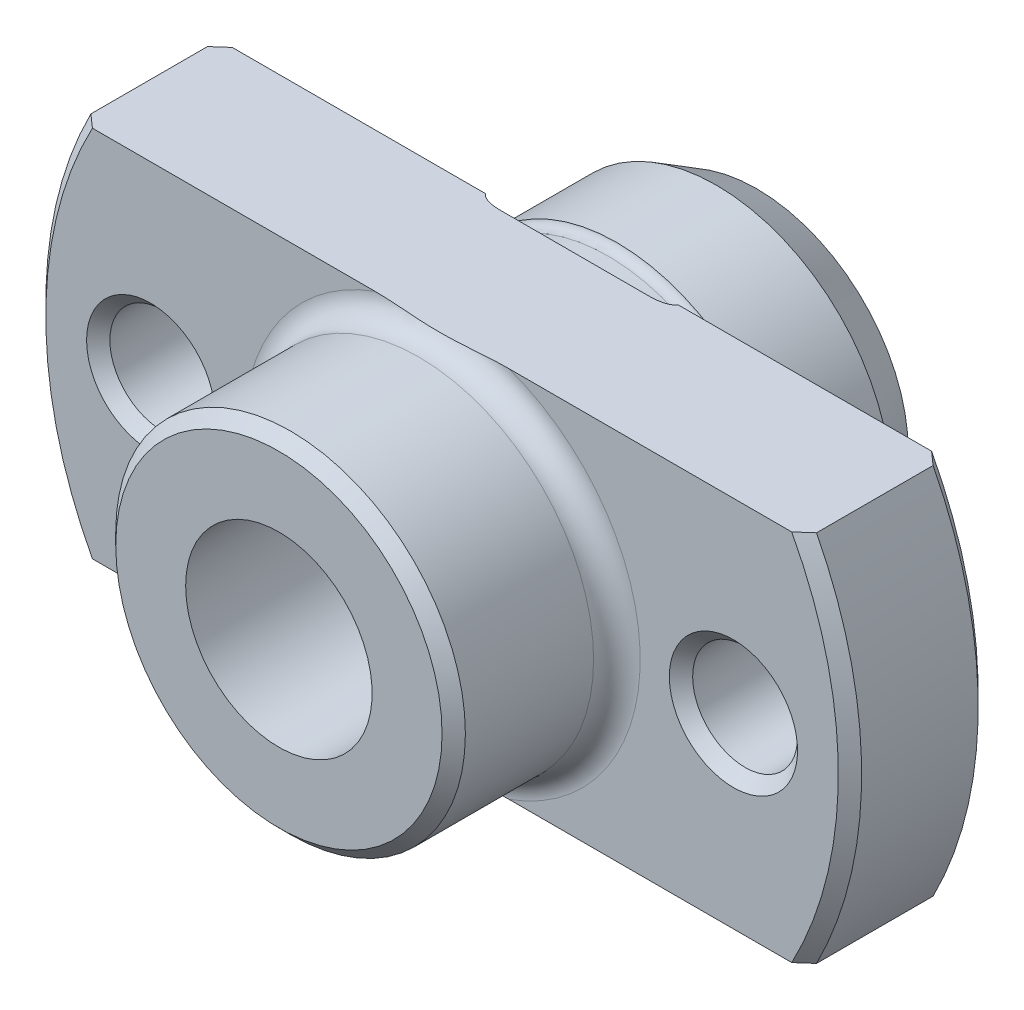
ISO-10303-21;
HEADER;
FILE_DESCRIPTION(('STEP AP214'),'2;1');
FILE_NAME('part.step','',(''),(''),'','','');
FILE_SCHEMA(('AUTOMOTIVE_DESIGN { 1 0 10303 214 1 1 1 1 }'));
ENDSEC;
DATA;
#1=APPLICATION_CONTEXT('core data for automotive mechanical design processes');
#2=APPLICATION_PROTOCOL_DEFINITION('international standard','automotive_design',2000,#1);
#3=PRODUCT_CONTEXT('',#1,'mechanical');
#4=PRODUCT('Part','Part','',(#3));
#5=PRODUCT_RELATED_PRODUCT_CATEGORY('part','',(#4));
#6=PRODUCT_DEFINITION_FORMATION('','',#4);
#7=PRODUCT_DEFINITION_CONTEXT('part definition',#1,'design');
#8=PRODUCT_DEFINITION('design','',#6,#7);
#9=PRODUCT_DEFINITION_SHAPE('','',#8);
#10=(LENGTH_UNIT() NAMED_UNIT(*) SI_UNIT(.MILLI.,.METRE.));
#11=(NAMED_UNIT(*) PLANE_ANGLE_UNIT() SI_UNIT($,.RADIAN.));
#12=(NAMED_UNIT(*) SI_UNIT($,.STERADIAN.) SOLID_ANGLE_UNIT());
#13=UNCERTAINTY_MEASURE_WITH_UNIT(LENGTH_MEASURE(1.E-05),#10,'distance_accuracy_value','');
#14=(GEOMETRIC_REPRESENTATION_CONTEXT(3) GLOBAL_UNCERTAINTY_ASSIGNED_CONTEXT((#13)) GLOBAL_UNIT_ASSIGNED_CONTEXT((#10,
#11,#12)) REPRESENTATION_CONTEXT('',''));
#15=CARTESIAN_POINT('',(0.,0.,0.));
#16=DIRECTION('',(0.,0.,1.));
#17=DIRECTION('',(1.,0.,0.));
#18=AXIS2_PLACEMENT_3D('',#15,#16,#17);
#19=CARTESIAN_POINT('',(7.5,0.,0.));
#20=DIRECTION('',(0.,0.,1.));
#21=DIRECTION('',(1.,0.,0.));
#22=AXIS2_PLACEMENT_3D('',#19,#20,#21);
#23=PLANE('',#22);
#24=CARTESIAN_POINT('',(-12.5,0.,0.));
#25=DIRECTION('',(0.,0.,1.));
#26=DIRECTION('',(1.,0.,0.));
#27=AXIS2_PLACEMENT_3D('',#24,#25,#26);
#28=CIRCLE('',#27,2.75);
#29=CARTESIAN_POINT('',(-9.75,0.,0.));
#30=VERTEX_POINT('',#29);
#31=EDGE_CURVE('E436',#30,#30,#28,.T.);
#32=ORIENTED_EDGE('',*,*,#31,.T.);
#33=EDGE_LOOP('',(#32));
#34=FACE_BOUND('',#33,.T.);
#35=DIRECTION('',(-1.,0.,0.));
#36=VECTOR('',#35,1.);
#37=CARTESIAN_POINT('',(7.5,-8.,0.));
#38=LINE('',#37,#36);
#39=CARTESIAN_POINT('',(-4.12310562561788,-8.,-2.29147231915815E-13));
#40=VERTEX_POINT('',#39);
#41=CARTESIAN_POINT('',(-15.,-8.,0.));
#42=VERTEX_POINT('',#41);
#43=EDGE_CURVE('E314',#40,#42,#38,.T.);
#44=ORIENTED_EDGE('',*,*,#43,.T.);
#45=CARTESIAN_POINT('',(0.,0.,0.));
#46=DIRECTION('',(0.,0.,1.));
#47=DIRECTION('',(1.,0.,0.));
#48=AXIS2_PLACEMENT_3D('',#45,#46,#47);
#49=CIRCLE('',#48,17.);
#50=CARTESIAN_POINT('',(-15.,8.,0.));
#51=VERTEX_POINT('',#50);
#52=EDGE_CURVE('E256',#42,#51,#49,.F.);
#53=ORIENTED_EDGE('',*,*,#52,.T.);
#54=DIRECTION('',(1.,0.,0.));
#55=VECTOR('',#54,1.);
#56=CARTESIAN_POINT('',(7.5,8.,0.));
#57=LINE('',#56,#55);
#58=CARTESIAN_POINT('',(-4.12310562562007,8.,4.68970137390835E-11));
#59=VERTEX_POINT('',#58);
#60=EDGE_CURVE('E395',#51,#59,#57,.T.);
#61=ORIENTED_EDGE('',*,*,#60,.T.);
#62=CARTESIAN_POINT('',(0.,0.,0.));
#63=DIRECTION('',(0.,0.,1.));
#64=DIRECTION('',(1.,0.,0.));
#65=AXIS2_PLACEMENT_3D('',#62,#63,#64);
#66=CIRCLE('',#65,9.);
#67=EDGE_CURVE('E287',#40,#59,#66,.F.);
#68=ORIENTED_EDGE('',*,*,#67,.F.);
#69=EDGE_LOOP('',(#44,#53,#61,#68));
#70=FACE_BOUND('',#69,.T.);
#71=ADVANCED_FACE('F14',(#34,#70),#23,.F.);
#72=CARTESIAN_POINT('',(8.5,0.,6.));
#73=DIRECTION('',(0.,0.,-1.));
#74=DIRECTION('',(-1.,0.,0.));
#75=AXIS2_PLACEMENT_3D('',#72,#73,#74);
#76=PLANE('',#75);
#77=CARTESIAN_POINT('',(12.5,0.,6.));
#78=DIRECTION('',(0.,0.,-1.));
#79=DIRECTION('',(-1.,0.,0.));
#80=AXIS2_PLACEMENT_3D('',#77,#78,#79);
#81=CIRCLE('',#80,2.75);
#82=CARTESIAN_POINT('',(9.75,0.,6.));
#83=VERTEX_POINT('',#82);
#84=EDGE_CURVE('E423',#83,#83,#81,.T.);
#85=ORIENTED_EDGE('',*,*,#84,.T.);
#86=EDGE_LOOP('',(#85));
#87=FACE_BOUND('',#86,.T.);
#88=DIRECTION('',(1.,0.,0.));
#89=VECTOR('',#88,1.);
#90=CARTESIAN_POINT('',(8.5,-8.,6.));
#91=LINE('',#90,#89);
#92=CARTESIAN_POINT('',(2.87228132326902,-8.,6.));
#93=VERTEX_POINT('',#92);
#94=CARTESIAN_POINT('',(15.,-8.,6.));
#95=VERTEX_POINT('',#94);
#96=EDGE_CURVE('E307',#93,#95,#91,.T.);
#97=ORIENTED_EDGE('',*,*,#96,.T.);
#98=CARTESIAN_POINT('',(0.,0.,6.));
#99=DIRECTION('',(0.,0.,-1.));
#100=DIRECTION('',(-1.,0.,0.));
#101=AXIS2_PLACEMENT_3D('',#98,#99,#100);
#102=CIRCLE('',#101,17.);
#103=CARTESIAN_POINT('',(15.,8.,6.));
#104=VERTEX_POINT('',#103);
#105=EDGE_CURVE('E529',#95,#104,#102,.F.);
#106=ORIENTED_EDGE('',*,*,#105,.T.);
#107=DIRECTION('',(-1.,0.,0.));
#108=VECTOR('',#107,1.);
#109=CARTESIAN_POINT('',(8.5,8.,6.));
#110=LINE('',#109,#108);
#111=CARTESIAN_POINT('',(2.87228132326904,8.,5.99999999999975));
#112=VERTEX_POINT('',#111);
#113=EDGE_CURVE('E330',#104,#112,#110,.T.);
#114=ORIENTED_EDGE('',*,*,#113,.T.);
#115=CARTESIAN_POINT('',(0.,0.,6.));
#116=DIRECTION('',(0.,0.,-1.));
#117=DIRECTION('',(-1.,0.,0.));
#118=AXIS2_PLACEMENT_3D('',#115,#116,#117);
#119=CIRCLE('',#118,8.5);
#120=EDGE_CURVE('E289',#112,#93,#119,.T.);
#121=ORIENTED_EDGE('',*,*,#120,.T.);
#122=EDGE_LOOP('',(#97,#106,#114,#121));
#123=FACE_BOUND('',#122,.T.);
#124=ADVANCED_FACE('F367',(#87,#123),#76,.F.);
#125=CARTESIAN_POINT('',(0.,0.,-20.2470119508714));
#126=DIRECTION('',(0.,0.,-1.));
#127=DIRECTION('',(-1.,0.,0.));
#128=AXIS2_PLACEMENT_3D('',#125,#126,#127);
#129=CYLINDRICAL_SURFACE('',#128,17.5);
#130=DIRECTION('',(0.,0.,1.));
#131=VECTOR('',#130,1.);
#132=CARTESIAN_POINT('',(-15.5643824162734,8.,-7.5));
#133=LINE('',#132,#131);
#134=CARTESIAN_POINT('',(-15.5643824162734,8.,0.500000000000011));
#135=VERTEX_POINT('',#134);
#136=CARTESIAN_POINT('',(-15.5643824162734,8.,5.5));
#137=VERTEX_POINT('',#136);
#138=EDGE_CURVE('E454',#135,#137,#133,.T.);
#139=ORIENTED_EDGE('',*,*,#138,.F.);
#140=CARTESIAN_POINT('',(0.,0.,0.500000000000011));
#141=DIRECTION('',(0.,0.,1.));
#142=DIRECTION('',(1.,0.,0.));
#143=AXIS2_PLACEMENT_3D('',#140,#141,#142);
#144=CIRCLE('',#143,17.5);
#145=CARTESIAN_POINT('',(-15.5643824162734,-8.,0.50000000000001));
#146=VERTEX_POINT('',#145);
#147=EDGE_CURVE('E261',#135,#146,#144,.T.);
#148=ORIENTED_EDGE('',*,*,#147,.T.);
#149=DIRECTION('',(0.,0.,1.));
#150=VECTOR('',#149,1.);
#151=CARTESIAN_POINT('',(-15.5643824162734,-8.,-7.5));
#152=LINE('',#151,#150);
#153=CARTESIAN_POINT('',(-15.5643824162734,-8.,5.5));
#154=VERTEX_POINT('',#153);
#155=EDGE_CURVE('E326',#146,#154,#152,.T.);
#156=ORIENTED_EDGE('',*,*,#155,.T.);
#157=CARTESIAN_POINT('',(0.,0.,5.5));
#158=DIRECTION('',(0.,0.,-1.));
#159=DIRECTION('',(-1.,0.,0.));
#160=AXIS2_PLACEMENT_3D('',#157,#158,#159);
#161=CIRCLE('',#160,17.5);
#162=EDGE_CURVE('E259',#154,#137,#161,.T.);
#163=ORIENTED_EDGE('',*,*,#162,.T.);
#164=EDGE_LOOP('',(#139,#148,#156,#163));
#165=FACE_BOUND('',#164,.T.);
#166=ADVANCED_FACE('F375',(#165),#129,.T.);
#167=CARTESIAN_POINT('',(0.,0.,-0.1));
#168=DIRECTION('',(0.,0.,1.));
#169=DIRECTION('',(1.,0.,0.));
#170=AXIS2_PLACEMENT_3D('',#167,#168,#169);
#171=TOROIDAL_SURFACE('',#170,8.61270166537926,0.4);
#172=ORIENTED_EDGE('',*,*,#67,.T.);
#173=CARTESIAN_POINT('',(-4.14407784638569,8.,-0.0505008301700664));
#174=CARTESIAN_POINT('',(-4.14046419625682,8.,-0.0371779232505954));
#175=CARTESIAN_POINT('',(-4.13545126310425,8.,-0.024214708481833));
#176=CARTESIAN_POINT('',(-4.12320975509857,8.,0.000641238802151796));
#177=CARTESIAN_POINT('',(-4.11597087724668,8.,0.0125286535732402));
#178=CARTESIAN_POINT('',(-4.09652172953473,8.,0.0398185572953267));
#179=CARTESIAN_POINT('',(-4.0834949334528,8.,0.0546331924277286));
#180=CARTESIAN_POINT('',(-4.05537793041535,8.,0.0821074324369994));
#181=CARTESIAN_POINT('',(-4.04028438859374,8.,0.0947634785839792));
#182=CARTESIAN_POINT('',(-3.99544778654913,8.,0.128202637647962));
#183=CARTESIAN_POINT('',(-3.96410365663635,8.,0.146815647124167));
#184=CARTESIAN_POINT('',(-3.89920170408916,8.,0.179568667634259));
#185=CARTESIAN_POINT('',(-3.86563808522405,8.,0.193696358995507));
#186=CARTESIAN_POINT('',(-3.79444722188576,8.,0.219559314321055));
#187=CARTESIAN_POINT('',(-3.75671398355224,8.,0.230998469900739));
#188=CARTESIAN_POINT('',(-3.68042031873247,8.,0.250742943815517));
#189=CARTESIAN_POINT('',(-3.64185901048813,8.,0.25904472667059));
#190=CARTESIAN_POINT('',(-3.56418038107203,8.,0.273095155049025));
#191=CARTESIAN_POINT('',(-3.52506188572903,8.,0.278837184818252));
#192=CARTESIAN_POINT('',(-3.44656105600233,8.,0.288135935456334));
#193=CARTESIAN_POINT('',(-3.40717863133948,8.,0.291691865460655));
#194=CARTESIAN_POINT('',(-3.28222243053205,8.,0.299971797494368));
#195=CARTESIAN_POINT('',(-3.19641011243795,8.,0.301211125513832));
#196=CARTESIAN_POINT('',(-3.02491709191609,8.,0.29665209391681));
#197=CARTESIAN_POINT('',(-2.9392367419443,8.,0.290843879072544));
#198=CARTESIAN_POINT('',(-2.76860450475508,8.,0.273003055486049));
#199=CARTESIAN_POINT('',(-2.6836519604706,8.,0.260976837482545));
#200=CARTESIAN_POINT('',(-2.55712901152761,8.,0.238239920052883));
#201=CARTESIAN_POINT('',(-2.51512407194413,8.,0.229882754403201));
#202=CARTESIAN_POINT('',(-2.43149076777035,8.,0.211467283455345));
#203=CARTESIAN_POINT('',(-2.38986233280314,8.,0.201409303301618));
#204=CARTESIAN_POINT('',(-2.3044395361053,8.,0.178611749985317));
#205=CARTESIAN_POINT('',(-2.26068026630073,8.,0.165740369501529));
#206=CARTESIAN_POINT('',(-2.17417208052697,8.,0.137176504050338));
#207=CARTESIAN_POINT('',(-2.13142081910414,8.,0.12149149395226));
#208=CARTESIAN_POINT('',(-2.06987842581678,8.,0.095173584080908));
#209=CARTESIAN_POINT('',(-2.05036044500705,8.,0.0862490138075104));
#210=CARTESIAN_POINT('',(-2.01199349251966,8.,0.0670770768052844));
#211=CARTESIAN_POINT('',(-1.99314369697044,8.,0.0568314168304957));
#212=CARTESIAN_POINT('',(-1.96037653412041,8.,0.0367392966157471));
#213=CARTESIAN_POINT('',(-1.94624371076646,8.,0.027246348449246));
#214=CARTESIAN_POINT('',(-1.91930203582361,8.,0.0065524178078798));
#215=CARTESIAN_POINT('',(-1.90648662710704,8.,-0.0046393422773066));
#216=CARTESIAN_POINT('',(-1.89046410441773,8.,-0.0220887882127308));
#217=CARTESIAN_POINT('',(-1.88610646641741,8.,-0.0272765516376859));
#218=CARTESIAN_POINT('',(-1.87801300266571,8.,-0.0381335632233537));
#219=CARTESIAN_POINT('',(-1.87427775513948,8.,-0.0438032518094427));
#220=CARTESIAN_POINT('',(-1.86764207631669,8.,-0.0557330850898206));
#221=CARTESIAN_POINT('',(-1.86475437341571,8.,-0.0620005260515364));
#222=CARTESIAN_POINT('',(-1.86023879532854,8.,-0.0749701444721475));
#223=CARTESIAN_POINT('',(-1.85860676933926,8.,-0.0816708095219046));
#224=CARTESIAN_POINT('',(-1.85696367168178,8.,-0.094563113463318));
#225=CARTESIAN_POINT('',(-1.85680132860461,8.,-0.100734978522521));
#226=CARTESIAN_POINT('',(-1.8577296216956,8.,-0.112985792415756));
#227=CARTESIAN_POINT('',(-1.85882145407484,8.,-0.119064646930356));
#228=CARTESIAN_POINT('',(-1.8622161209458,8.,-0.131355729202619));
#229=CARTESIAN_POINT('',(-1.86460357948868,8.,-0.137543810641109));
#230=CARTESIAN_POINT('',(-1.87033483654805,8.,-0.149456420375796));
#231=CARTESIAN_POINT('',(-1.87368037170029,8.,-0.155180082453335));
#232=CARTESIAN_POINT('',(-1.88364493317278,8.,-0.170021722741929));
#233=CARTESIAN_POINT('',(-1.89091198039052,8.,-0.178697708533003));
#234=CARTESIAN_POINT('',(-1.90656958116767,8.,-0.194957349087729));
#235=CARTESIAN_POINT('',(-1.9149636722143,8.,-0.202537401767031));
#236=CARTESIAN_POINT('',(-1.93699446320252,8.,-0.220603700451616));
#237=CARTESIAN_POINT('',(-1.95107805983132,8.,-0.23053799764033));
#238=CARTESIAN_POINT('',(-1.98009762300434,8.,-0.249092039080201));
#239=CARTESIAN_POINT('',(-1.99503553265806,8.,-0.257708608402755));
#240=CARTESIAN_POINT('',(-2.02551332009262,8.,-0.274011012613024));
#241=CARTESIAN_POINT('',(-2.04105607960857,8.,-0.281691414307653));
#242=CARTESIAN_POINT('',(-2.07247246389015,8.,-0.29628166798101));
#243=CARTESIAN_POINT('',(-2.08834569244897,8.,-0.303192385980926));
#244=CARTESIAN_POINT('',(-2.13451347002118,8.,-0.322262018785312));
#245=CARTESIAN_POINT('',(-2.16512719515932,8.,-0.333647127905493));
#246=CARTESIAN_POINT('',(-2.2268984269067,8.,-0.354846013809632));
#247=CARTESIAN_POINT('',(-2.25805622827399,8.,-0.364658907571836));
#248=CARTESIAN_POINT('',(-2.35220089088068,8.,-0.392250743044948));
#249=CARTESIAN_POINT('',(-2.41574355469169,8.,-0.408138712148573));
#250=CARTESIAN_POINT('',(-2.54372887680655,8.,-0.436028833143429));
#251=CARTESIAN_POINT('',(-2.6081725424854,8.,-0.448026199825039));
#252=CARTESIAN_POINT('',(-2.73755116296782,8.,-0.46839815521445));
#253=CARTESIAN_POINT('',(-2.80248542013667,8.,-0.476777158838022));
#254=CARTESIAN_POINT('',(-2.93248749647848,8.,-0.489853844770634));
#255=CARTESIAN_POINT('',(-2.99755397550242,8.,-0.494564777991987));
#256=CARTESIAN_POINT('',(-3.12791921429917,8.,-0.500018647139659));
#257=CARTESIAN_POINT('',(-3.19321812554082,8.,-0.500758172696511));
#258=CARTESIAN_POINT('',(-3.32349856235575,8.,-0.497626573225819));
#259=CARTESIAN_POINT('',(-3.38848040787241,8.,-0.493771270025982));
#260=CARTESIAN_POINT('',(-3.51781010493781,8.,-0.480437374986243));
#261=CARTESIAN_POINT('',(-3.58215876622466,8.,-0.470967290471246));
#262=CARTESIAN_POINT('',(-3.69495673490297,8.,-0.447585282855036));
#263=CARTESIAN_POINT('',(-3.74369923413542,8.,-0.435169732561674));
#264=CARTESIAN_POINT('',(-3.81530597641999,8.,-0.412118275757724));
#265=CARTESIAN_POINT('',(-3.83888677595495,8.,-0.40371359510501));
#266=CARTESIAN_POINT('',(-3.88533786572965,8.,-0.385144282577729));
#267=CARTESIAN_POINT('',(-3.90820871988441,8.,-0.374981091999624));
#268=CARTESIAN_POINT('',(-3.9489743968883,8.,-0.354483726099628));
#269=CARTESIAN_POINT('',(-3.96703934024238,8.,-0.344491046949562));
#270=CARTESIAN_POINT('',(-4.00214794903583,8.,-0.322738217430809));
#271=CARTESIAN_POINT('',(-4.01918933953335,8.,-0.310974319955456));
#272=CARTESIAN_POINT('',(-4.0518572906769,8.,-0.28518054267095));
#273=CARTESIAN_POINT('',(-4.06746257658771,8.,-0.271123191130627));
#274=CARTESIAN_POINT('',(-4.09595719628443,8.,-0.240482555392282));
#275=CARTESIAN_POINT('',(-4.10885910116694,8.,-0.223911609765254));
#276=CARTESIAN_POINT('',(-4.12553224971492,8.,-0.196144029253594));
#277=CARTESIAN_POINT('',(-4.13080743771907,8.,-0.185854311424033));
#278=CARTESIAN_POINT('',(-4.13968065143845,8.,-0.164565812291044));
#279=CARTESIAN_POINT('',(-4.14327977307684,8.,-0.153567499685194));
#280=CARTESIAN_POINT('',(-4.14849845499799,8.,-0.131001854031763));
#281=CARTESIAN_POINT('',(-4.15010075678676,8.,-0.119430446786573));
#282=CARTESIAN_POINT('',(-4.15108343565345,8.,-0.0962014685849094));
#283=CARTESIAN_POINT('',(-4.15046748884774,8.,-0.0845440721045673));
#284=CARTESIAN_POINT('',(-4.14822859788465,8.,-0.0692579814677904));
#285=CARTESIAN_POINT('',(-4.14755402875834,8.,-0.0654714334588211));
#286=CARTESIAN_POINT('',(-4.14598163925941,8.,-0.0579475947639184));
#287=CARTESIAN_POINT('',(-4.14508397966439,8.,-0.0542102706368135));
#288=CARTESIAN_POINT('',(-4.14407784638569,8.,-0.0505008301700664));
#289=B_SPLINE_CURVE_WITH_KNOTS('',3,(#173,#174,#175,#176,#177,#178,#179,#180,#181,#182,#183,
#184,#185,#186,#187,#188,#189,#190,#191,#192,#193,#194,#195,#196,#197,#198,#199,#200,#201,#202,
#203,#204,#205,#206,#207,#208,#209,#210,#211,#212,#213,#214,#215,#216,#217,#218,#219,#220,#221,
#222,#223,#224,#225,#226,#227,#228,#229,#230,#231,#232,#233,#234,#235,#236,#237,#238,#239,#240,
#241,#242,#243,#244,#245,#246,#247,#248,#249,#250,#251,#252,#253,#254,#255,#256,#257,#258,#259,
#260,#261,#262,#263,#264,#265,#266,#267,#268,#269,#270,#271,#272,#273,#274,#275,#276,#277,#278,
#279,#280,#281,#282,#283,#284,#285,#286,#287,#288),.UNSPECIFIED.,.T.,.F.,(4,2,2,2,2,2,2,2,2,2,2,
2,2,2,2,2,2,2,2,2,2,2,2,2,2,2,2,2,2,2,2,2,2,2,2,2,2,2,2,2,2,2,2,2,2,2,2,2,2,2,2,2,2,2,2,2,2,4),
(0.,0.0413954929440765,0.0829855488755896,0.141830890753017,0.200772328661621,0.309522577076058,
0.418568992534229,0.536671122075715,0.654905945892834,0.773444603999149,0.892026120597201,
1.14907591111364,1.40648557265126,1.66363119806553,1.79209030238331,1.92052487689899,
2.05730758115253,2.19373214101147,2.25808764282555,2.32236081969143,2.37337754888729,
2.42412662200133,2.44441828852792,2.46472870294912,2.48533013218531,2.50586316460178,
2.52425524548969,2.54266488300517,2.56245419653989,2.58227961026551,2.61604020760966,
2.64990936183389,2.70148212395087,2.75317725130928,2.80515939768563,2.85708245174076,
2.95500058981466,3.052973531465,3.24928902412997,3.44584506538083,3.64216059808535,
3.83776360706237,4.03353455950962,4.22863333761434,4.42343726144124,4.57401865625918,
4.64906685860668,4.72405383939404,4.78591154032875,4.84790199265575,4.91069838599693,
4.97319594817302,5.00776895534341,5.04231932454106,5.07716628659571,5.11195552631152,
5.12348938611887,5.13501495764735),.UNSPECIFIED.);
#290=CARTESIAN_POINT('',(-3.19039652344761,8.,0.3));
#291=VERTEX_POINT('',#290);
#292=EDGE_CURVE('E126',#59,#291,#289,.T.);
#293=ORIENTED_EDGE('',*,*,#292,.T.);
#294=CARTESIAN_POINT('',(0.,0.,0.3));
#295=DIRECTION('',(0.,0.,-1.));
#296=DIRECTION('',(-1.,0.,0.));
#297=AXIS2_PLACEMENT_3D('',#294,#295,#296);
#298=CIRCLE('',#297,8.61270166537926);
#299=CARTESIAN_POINT('',(-3.19039652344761,-8.,0.3));
#300=VERTEX_POINT('',#299);
#301=EDGE_CURVE('E137',#300,#291,#298,.T.);
#302=ORIENTED_EDGE('',*,*,#301,.F.);
#303=CARTESIAN_POINT('',(-4.14407784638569,-8.,-0.0505008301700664));
#304=CARTESIAN_POINT('',(-4.14684210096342,-8.,-0.0606992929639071));
#305=CARTESIAN_POINT('',(-4.14879335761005,-8.,-0.0711245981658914));
#306=CARTESIAN_POINT('',(-4.15089156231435,-8.,-0.0921558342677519));
#307=CARTESIAN_POINT('',(-4.15103893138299,-8.,-0.102761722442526));
#308=CARTESIAN_POINT('',(-4.14951695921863,-8.,-0.12383024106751));
#309=CARTESIAN_POINT('',(-4.147849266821,-8.,-0.134292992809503));
#310=CARTESIAN_POINT('',(-4.14285267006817,-8.,-0.154811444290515));
#311=CARTESIAN_POINT('',(-4.13952255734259,-8.,-0.164866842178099));
#312=CARTESIAN_POINT('',(-4.1300246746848,-8.,-0.187832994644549));
#313=CARTESIAN_POINT('',(-4.1232703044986,-8.,-0.20049983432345));
#314=CARTESIAN_POINT('',(-4.1078326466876,-8.,-0.224593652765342));
#315=CARTESIAN_POINT('',(-4.09914504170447,-8.,-0.236017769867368));
#316=CARTESIAN_POINT('',(-4.07470005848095,-8.,-0.264217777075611));
#317=CARTESIAN_POINT('',(-4.05785031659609,-8.,-0.280037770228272));
#318=CARTESIAN_POINT('',(-4.02203812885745,-8.,-0.309044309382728));
#319=CARTESIAN_POINT('',(-4.00307026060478,-8.,-0.322223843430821));
#320=CARTESIAN_POINT('',(-3.96426305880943,-8.,-0.346152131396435));
#321=CARTESIAN_POINT('',(-3.9444527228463,-8.,-0.356948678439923));
#322=CARTESIAN_POINT('',(-3.90398770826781,-8.,-0.376840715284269));
#323=CARTESIAN_POINT('',(-3.88333223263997,-8.,-0.385934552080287));
#324=CARTESIAN_POINT('',(-3.82046318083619,-8.,-0.411101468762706));
#325=CARTESIAN_POINT('',(-3.77739488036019,-8.,-0.42503278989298));
#326=CARTESIAN_POINT('',(-3.6852513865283,-8.,-0.449982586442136));
#327=CARTESIAN_POINT('',(-3.63604678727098,-8.,-0.460494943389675));
#328=CARTESIAN_POINT('',(-3.53690717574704,-8.,-0.477468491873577));
#329=CARTESIAN_POINT('',(-3.48697137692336,-8.,-0.483924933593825));
#330=CARTESIAN_POINT('',(-3.38667276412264,-8.,-0.493529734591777));
#331=CARTESIAN_POINT('',(-3.33630920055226,-8.,-0.496669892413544));
#332=CARTESIAN_POINT('',(-3.2354702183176,-8.,-0.500114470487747));
#333=CARTESIAN_POINT('',(-3.18499475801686,-8.,-0.500417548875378));
#334=CARTESIAN_POINT('',(-3.06279342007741,-8.,-0.498128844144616));
#335=CARTESIAN_POINT('',(-2.99109108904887,-8.,-0.494261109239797));
#336=CARTESIAN_POINT('',(-2.8480888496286,-8.,-0.482060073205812));
#337=CARTESIAN_POINT('',(-2.77678888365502,-8.,-0.473727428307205));
#338=CARTESIAN_POINT('',(-2.63502742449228,-8.,-0.452781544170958));
#339=CARTESIAN_POINT('',(-2.5645641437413,-8.,-0.440180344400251));
#340=CARTESIAN_POINT('',(-2.42464443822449,-8.,-0.410396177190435));
#341=CARTESIAN_POINT('',(-2.35518711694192,-8.,-0.393217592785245));
#342=CARTESIAN_POINT('',(-2.2507573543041,-8.,-0.362469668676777));
#343=CARTESIAN_POINT('',(-2.2151392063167,-8.,-0.351087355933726));
#344=CARTESIAN_POINT('',(-2.14463018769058,-8.,-0.326166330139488));
#345=CARTESIAN_POINT('',(-2.10973936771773,-8.,-0.312627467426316));
#346=CARTESIAN_POINT('',(-2.05083685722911,-8.,-0.286564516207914));
#347=CARTESIAN_POINT('',(-2.02648948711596,-8.,-0.274798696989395));
#348=CARTESIAN_POINT('',(-1.97903104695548,-8.,-0.248777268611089));
#349=CARTESIAN_POINT('',(-1.95592058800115,-8.,-0.234520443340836));
#350=CARTESIAN_POINT('',(-1.92352648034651,-8.,-0.209868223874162));
#351=CARTESIAN_POINT('',(-1.91305960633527,-8.,-0.201052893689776));
#352=CARTESIAN_POINT('',(-1.89362948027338,-8.,-0.181912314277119));
#353=CARTESIAN_POINT('',(-1.88465609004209,-8.,-0.171598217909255));
#354=CARTESIAN_POINT('',(-1.87384138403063,-8.,-0.155387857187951));
#355=CARTESIAN_POINT('',(-1.87083215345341,-8.,-0.150281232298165));
#356=CARTESIAN_POINT('',(-1.86556022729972,-8.,-0.139689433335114));
#357=CARTESIAN_POINT('',(-1.86329718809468,-8.,-0.134204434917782));
#358=CARTESIAN_POINT('',(-1.85971315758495,-8.,-0.122852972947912));
#359=CARTESIAN_POINT('',(-1.85840369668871,-8.,-0.116982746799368));
#360=CARTESIAN_POINT('',(-1.85695492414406,-8.,-0.105100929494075));
#361=CARTESIAN_POINT('',(-1.85681411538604,-8.,-0.0990895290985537));
#362=CARTESIAN_POINT('',(-1.85766627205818,-8.,-0.087856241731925));
#363=CARTESIAN_POINT('',(-1.85852937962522,-8.,-0.0826237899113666));
#364=CARTESIAN_POINT('',(-1.86108177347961,-8.,-0.0723647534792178));
#365=CARTESIAN_POINT('',(-1.86277191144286,-8.,-0.0673383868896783));
#366=CARTESIAN_POINT('',(-1.86778452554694,-8.,-0.0552668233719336));
#367=CARTESIAN_POINT('',(-1.87150090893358,-8.,-0.0483870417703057));
#368=CARTESIAN_POINT('',(-1.87993955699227,-8.,-0.0352778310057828));
#369=CARTESIAN_POINT('',(-1.88466465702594,-8.,-0.0290503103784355));
#370=CARTESIAN_POINT('',(-1.89945392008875,-8.,-0.0116814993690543));
#371=CARTESIAN_POINT('',(-1.91041671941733,-8.,-0.00131772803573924));
#372=CARTESIAN_POINT('',(-1.93357172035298,-8.,0.0179057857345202));
#373=CARTESIAN_POINT('',(-1.94576787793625,-8.,0.0267604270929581));
#374=CARTESIAN_POINT('',(-1.98026756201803,-8.,0.049638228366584));
#375=CARTESIAN_POINT('',(-2.00329390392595,-8.,0.0625596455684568));
#376=CARTESIAN_POINT('',(-2.05037779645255,-8.,0.0863970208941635));
#377=CARTESIAN_POINT('',(-2.07443785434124,-8.,0.0973077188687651));
#378=CARTESIAN_POINT('',(-2.12330374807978,-8.,0.117744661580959));
#379=CARTESIAN_POINT('',(-2.14811315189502,-8.,0.127262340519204));
#380=CARTESIAN_POINT('',(-2.19809584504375,-8.,0.145164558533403));
#381=CARTESIAN_POINT('',(-2.22326865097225,-8.,0.153550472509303));
#382=CARTESIAN_POINT('',(-2.2909025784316,-8.,0.174740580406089));
#383=CARTESIAN_POINT('',(-2.33361951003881,-8.,0.186729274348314));
#384=CARTESIAN_POINT('',(-2.41957341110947,-8.,0.208687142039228));
#385=CARTESIAN_POINT('',(-2.46281057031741,-8.,0.218655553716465));
#386=CARTESIAN_POINT('',(-2.59323404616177,-8.,0.245950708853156));
#387=CARTESIAN_POINT('',(-2.68098639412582,-8.,0.260624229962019));
#388=CARTESIAN_POINT('',(-2.85687855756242,-8.,0.283342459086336));
#389=CARTESIAN_POINT('',(-2.94501424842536,-8.,0.291419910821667));
#390=CARTESIAN_POINT('',(-3.12155154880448,-8.,0.300428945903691));
#391=CARTESIAN_POINT('',(-3.20995244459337,-8.,0.301372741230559));
#392=CARTESIAN_POINT('',(-3.34788144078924,-8.,0.296012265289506));
#393=CARTESIAN_POINT('',(-3.39752599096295,-8.,0.292693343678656));
#394=CARTESIAN_POINT('',(-3.49658727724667,-8.,0.282754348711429));
#395=CARTESIAN_POINT('',(-3.54600337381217,-8.,0.276127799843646));
#396=CARTESIAN_POINT('',(-3.65244729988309,-8.,0.257387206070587));
#397=CARTESIAN_POINT('',(-3.70935842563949,-8.,0.244538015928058));
#398=CARTESIAN_POINT('',(-3.79295245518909,-8.,0.219662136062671));
#399=CARTESIAN_POINT('',(-3.82047495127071,-8.,0.21045752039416));
#400=CARTESIAN_POINT('',(-3.87464136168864,-8.,0.189774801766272));
#401=CARTESIAN_POINT('',(-3.90128626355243,-8.,0.178299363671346));
#402=CARTESIAN_POINT('',(-3.94650267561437,-8.,0.155829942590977));
#403=CARTESIAN_POINT('',(-3.965387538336,-8.,0.145471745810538));
#404=CARTESIAN_POINT('',(-4.00206482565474,-8.,0.122830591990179));
#405=CARTESIAN_POINT('',(-4.01985410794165,-8.,0.110542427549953));
#406=CARTESIAN_POINT('',(-4.0539092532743,-8.,0.0834577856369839));
#407=CARTESIAN_POINT('',(-4.07014665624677,-8.,0.0686247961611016));
#408=CARTESIAN_POINT('',(-4.09952120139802,-8.,0.0361772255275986));
#409=CARTESIAN_POINT('',(-4.11267896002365,-8.,0.0185825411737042));
#410=CARTESIAN_POINT('',(-4.12776818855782,-8.,-0.0083083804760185));
#411=CARTESIAN_POINT('',(-4.13176839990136,-8.,-0.0164504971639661));
#412=CARTESIAN_POINT('',(-4.13873787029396,-8.,-0.0331729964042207));
#413=CARTESIAN_POINT('',(-4.14170690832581,-8.,-0.0417534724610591));
#414=CARTESIAN_POINT('',(-4.14407784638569,-8.,-0.0505008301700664));
#415=B_SPLINE_CURVE_WITH_KNOTS('',3,(#303,#304,#305,#306,#307,#308,#309,#310,#311,#312,#313,
#314,#315,#316,#317,#318,#319,#320,#321,#322,#323,#324,#325,#326,#327,#328,#329,#330,#331,#332,
#333,#334,#335,#336,#337,#338,#339,#340,#341,#342,#343,#344,#345,#346,#347,#348,#349,#350,#351,
#352,#353,#354,#355,#356,#357,#358,#359,#360,#361,#362,#363,#364,#365,#366,#367,#368,#369,#370,
#371,#372,#373,#374,#375,#376,#377,#378,#379,#380,#381,#382,#383,#384,#385,#386,#387,#388,#389,
#390,#391,#392,#393,#394,#395,#396,#397,#398,#399,#400,#401,#402,#403,#404,#405,#406,#407,#408,
#409,#410,#411,#412,#413,#414),.UNSPECIFIED.,.T.,.F.,(4,2,2,2,2,2,2,2,2,2,2,2,2,2,2,2,2,2,2,2,2,
2,2,2,2,2,2,2,2,2,2,2,2,2,2,2,2,2,2,2,2,2,2,2,2,2,2,2,2,2,2,2,2,2,2,4),(0.,0.0316697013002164,
0.0633320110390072,0.0949655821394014,0.126622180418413,0.169445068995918,0.21236456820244,
0.281312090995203,0.350440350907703,0.418021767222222,0.485668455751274,0.621125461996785,
0.771868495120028,0.922787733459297,1.07407934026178,1.22544250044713,1.44069757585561,
1.65592102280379,1.87054241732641,2.08495903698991,2.19709875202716,2.30924625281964,
2.39031958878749,2.47143261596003,2.5124089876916,2.55309472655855,2.57083131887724,
2.58855973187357,2.60649910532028,2.62441549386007,2.64024976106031,2.65610036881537,
2.6794237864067,2.70281364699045,2.74781905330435,2.79297369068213,2.87197980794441,
2.95118976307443,3.03086798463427,3.11044852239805,3.24347975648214,3.37656107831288,
3.64317893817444,3.90846508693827,4.17329699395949,4.32247238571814,4.471940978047,
4.64653283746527,4.73352408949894,4.82041385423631,4.88494763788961,4.94965863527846,
5.01539048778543,5.08066884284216,5.10782655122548,5.13499007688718),.UNSPECIFIED.);
#416=EDGE_CURVE('E127',#300,#40,#415,.T.);
#417=ORIENTED_EDGE('',*,*,#416,.T.);
#418=EDGE_LOOP('',(#172,#293,#302,#417));
#419=FACE_BOUND('',#418,.T.);
#420=ADVANCED_FACE('F380',(#419),#171,.F.);
#421=CARTESIAN_POINT('',(12.5,0.,0.));
#422=DIRECTION('',(0.,0.,1.));
#423=DIRECTION('',(1.,0.,0.));
#424=AXIS2_PLACEMENT_3D('',#421,#422,#423);
#425=CIRCLE('',#424,2.75);
#426=CARTESIAN_POINT('',(15.25,0.,0.));
#427=VERTEX_POINT('',#426);
#428=EDGE_CURVE('E392',#427,#427,#425,.T.);
#429=ORIENTED_EDGE('',*,*,#428,.T.);
#430=EDGE_LOOP('',(#429));
#431=FACE_BOUND('',#430,.T.);
#432=CARTESIAN_POINT('',(4.1231056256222,7.99999999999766,0.));
#433=VERTEX_POINT('',#432);
#434=CARTESIAN_POINT('',(15.,8.,0.));
#435=VERTEX_POINT('',#434);
#436=EDGE_CURVE('E121',#433,#435,#57,.T.);
#437=ORIENTED_EDGE('',*,*,#436,.T.);
#438=CARTESIAN_POINT('',(0.,0.,0.));
#439=DIRECTION('',(0.,0.,1.));
#440=DIRECTION('',(1.,0.,0.));
#441=AXIS2_PLACEMENT_3D('',#438,#439,#440);
#442=CIRCLE('',#441,17.);
#443=CARTESIAN_POINT('',(15.,-8.,0.));
#444=VERTEX_POINT('',#443);
#445=EDGE_CURVE('E253',#435,#444,#442,.F.);
#446=ORIENTED_EDGE('',*,*,#445,.T.);
#447=CARTESIAN_POINT('',(4.12310562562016,-8.,-4.43300749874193E-12));
#448=VERTEX_POINT('',#447);
#449=EDGE_CURVE('E319',#444,#448,#38,.T.);
#450=ORIENTED_EDGE('',*,*,#449,.T.);
#451=EDGE_CURVE('E292',#433,#448,#66,.F.);
#452=ORIENTED_EDGE('',*,*,#451,.F.);
#453=EDGE_LOOP('',(#437,#446,#450,#452));
#454=FACE_BOUND('',#453,.T.);
#455=ADVANCED_FACE('F370',(#431,#454),#23,.F.);
#456=CARTESIAN_POINT('',(0.,0.,-20.2470119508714));
#457=DIRECTION('',(0.,0.,-1.));
#458=DIRECTION('',(-1.,0.,0.));
#459=AXIS2_PLACEMENT_3D('',#456,#457,#458);
#460=CYLINDRICAL_SURFACE('',#459,7.5);
#461=CARTESIAN_POINT('',(0.,0.,-5.76794919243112));
#462=DIRECTION('',(0.,0.,1.));
#463=DIRECTION('',(1.,0.,0.));
#464=AXIS2_PLACEMENT_3D('',#461,#462,#463);
#465=CIRCLE('',#464,7.5);
#466=CARTESIAN_POINT('',(7.5,0.,-5.76794919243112));
#467=VERTEX_POINT('',#466);
#468=EDGE_CURVE('E417',#467,#467,#465,.T.);
#469=ORIENTED_EDGE('',*,*,#468,.T.);
#470=EDGE_LOOP('',(#469));
#471=FACE_BOUND('',#470,.T.);
#472=CARTESIAN_POINT('',(0.,0.,-1.5));
#473=DIRECTION('',(0.,0.,1.));
#474=DIRECTION('',(1.,0.,0.));
#475=AXIS2_PLACEMENT_3D('',#472,#473,#474);
#476=CIRCLE('',#475,7.5);
#477=CARTESIAN_POINT('',(7.5,0.,-1.5));
#478=VERTEX_POINT('',#477);
#479=EDGE_CURVE('E302',#478,#478,#476,.T.);
#480=ORIENTED_EDGE('',*,*,#479,.F.);
#481=EDGE_LOOP('',(#480));
#482=FACE_BOUND('',#481,.T.);
#483=ADVANCED_FACE('F281',(#471,#482),#460,.T.);
#484=CARTESIAN_POINT('',(2.7,0.,-6.5));
#485=DIRECTION('',(0.,0.,-1.));
#486=DIRECTION('',(-1.,0.,0.));
#487=AXIS2_PLACEMENT_3D('',#484,#485,#486);
#488=PLANE('',#487);
#489=CARTESIAN_POINT('',(0.,0.,-6.5));
#490=DIRECTION('',(0.,0.,-1.));
#491=DIRECTION('',(-1.,0.,0.));
#492=AXIS2_PLACEMENT_3D('',#489,#490,#491);
#493=CIRCLE('',#492,4.1);
#494=CARTESIAN_POINT('',(-4.1,0.,-6.5));
#495=VERTEX_POINT('',#494);
#496=EDGE_CURVE('E265',#495,#495,#493,.F.);
#497=ORIENTED_EDGE('',*,*,#496,.T.);
#498=EDGE_LOOP('',(#497));
#499=FACE_BOUND('',#498,.T.);
#500=CARTESIAN_POINT('',(0.,0.,-6.5));
#501=DIRECTION('',(0.,0.,-1.));
#502=DIRECTION('',(-1.,0.,0.));
#503=AXIS2_PLACEMENT_3D('',#500,#501,#502);
#504=CIRCLE('',#503,2.7);
#505=CARTESIAN_POINT('',(-2.7,0.,-6.5));
#506=VERTEX_POINT('',#505);
#507=EDGE_CURVE('E284',#506,#506,#504,.T.);
#508=ORIENTED_EDGE('',*,*,#507,.T.);
#509=EDGE_LOOP('',(#508));
#510=FACE_BOUND('',#509,.T.);
#511=ADVANCED_FACE('F277',(#499,#510),#488,.F.);
#512=CARTESIAN_POINT('',(0.,0.,-20.2470119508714));
#513=DIRECTION('',(0.,0.,-1.));
#514=DIRECTION('',(-1.,0.,0.));
#515=AXIS2_PLACEMENT_3D('',#512,#513,#514);
#516=CYLINDRICAL_SURFACE('',#515,4.);
#517=CARTESIAN_POINT('',(0.,0.,0.));
#518=DIRECTION('',(0.,0.,1.));
#519=DIRECTION('',(1.,0.,0.));
#520=AXIS2_PLACEMENT_3D('',#517,#518,#519);
#521=CIRCLE('',#520,4.);
#522=CARTESIAN_POINT('',(4.,0.,0.));
#523=VERTEX_POINT('',#522);
#524=EDGE_CURVE('E456',#523,#523,#521,.T.);
#525=ORIENTED_EDGE('',*,*,#524,.F.);
#526=EDGE_LOOP('',(#525));
#527=FACE_BOUND('',#526,.T.);
#528=CARTESIAN_POINT('',(0.,0.,13.));
#529=DIRECTION('',(0.,0.,-1.));
#530=DIRECTION('',(-1.,0.,0.));
#531=AXIS2_PLACEMENT_3D('',#528,#529,#530);
#532=CIRCLE('',#531,4.);
#533=CARTESIAN_POINT('',(-4.,0.,13.));
#534=VERTEX_POINT('',#533);
#535=EDGE_CURVE('E148',#534,#534,#532,.T.);
#536=ORIENTED_EDGE('',*,*,#535,.F.);
#537=EDGE_LOOP('',(#536));
#538=FACE_BOUND('',#537,.T.);
#539=ADVANCED_FACE('F280',(#527,#538),#516,.F.);
#540=CARTESIAN_POINT('',(4.,0.,13.));
#541=DIRECTION('',(0.,0.,-1.));
#542=DIRECTION('',(-1.,0.,0.));
#543=AXIS2_PLACEMENT_3D('',#540,#541,#542);
#544=PLANE('',#543);
#545=CARTESIAN_POINT('',(0.,0.,13.));
#546=DIRECTION('',(0.,0.,-1.));
#547=DIRECTION('',(-1.,0.,0.));
#548=AXIS2_PLACEMENT_3D('',#545,#546,#547);
#549=CIRCLE('',#548,7.);
#550=CARTESIAN_POINT('',(-7.,0.,13.));
#551=VERTEX_POINT('',#550);
#552=EDGE_CURVE('E409',#551,#551,#549,.F.);
#553=ORIENTED_EDGE('',*,*,#552,.T.);
#554=EDGE_LOOP('',(#553));
#555=FACE_BOUND('',#554,.T.);
#556=ORIENTED_EDGE('',*,*,#535,.T.);
#557=EDGE_LOOP('',(#556));
#558=FACE_BOUND('',#557,.T.);
#559=ADVANCED_FACE('F353',(#555,#558),#544,.F.);
#560=CARTESIAN_POINT('',(0.,0.,-20.2470119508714));
#561=DIRECTION('',(0.,0.,-1.));
#562=DIRECTION('',(-1.,0.,0.));
#563=AXIS2_PLACEMENT_3D('',#560,#561,#562);
#564=CYLINDRICAL_SURFACE('',#563,7.5);
#565=CARTESIAN_POINT('',(0.,0.,12.5));
#566=DIRECTION('',(0.,0.,-1.));
#567=DIRECTION('',(-1.,0.,0.));
#568=AXIS2_PLACEMENT_3D('',#565,#566,#567);
#569=CIRCLE('',#568,7.5);
#570=CARTESIAN_POINT('',(-7.5,0.,12.5));
#571=VERTEX_POINT('',#570);
#572=EDGE_CURVE('E414',#571,#571,#569,.T.);
#573=ORIENTED_EDGE('',*,*,#572,.T.);
#574=EDGE_LOOP('',(#573));
#575=FACE_BOUND('',#574,.T.);
#576=CARTESIAN_POINT('',(0.,0.,7.));
#577=DIRECTION('',(0.,0.,-1.));
#578=DIRECTION('',(-1.,0.,0.));
#579=AXIS2_PLACEMENT_3D('',#576,#577,#578);
#580=CIRCLE('',#579,7.5);
#581=CARTESIAN_POINT('',(-7.5,0.,7.));
#582=VERTEX_POINT('',#581);
#583=EDGE_CURVE('E297',#582,#582,#580,.T.);
#584=ORIENTED_EDGE('',*,*,#583,.F.);
#585=EDGE_LOOP('',(#584));
#586=FACE_BOUND('',#585,.T.);
#587=ADVANCED_FACE('F347',(#575,#586),#564,.T.);
#588=CARTESIAN_POINT('',(0.,0.,7.));
#589=DIRECTION('',(0.,0.,-1.));
#590=DIRECTION('',(-1.,0.,0.));
#591=AXIS2_PLACEMENT_3D('',#588,#589,#590);
#592=TOROIDAL_SURFACE('',#591,8.5,1.);
#593=ORIENTED_EDGE('',*,*,#120,.F.);
#594=CARTESIAN_POINT('',(0.,8.,6.13397459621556));
#595=CARTESIAN_POINT('',(-0.166302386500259,8.,6.13396927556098));
#596=CARTESIAN_POINT('',(-0.332606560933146,8.,6.13091213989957));
#597=CARTESIAN_POINT('',(-0.665120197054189,8.,6.11946219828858));
#598=CARTESIAN_POINT('',(-0.831329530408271,8.,6.11106598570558));
#599=CARTESIAN_POINT('',(-1.16464241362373,8.,6.09097612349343));
#600=CARTESIAN_POINT('',(-1.33174454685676,8.,6.07926088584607));
#601=CARTESIAN_POINT('',(-1.66586475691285,8.,6.05546035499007));
#602=CARTESIAN_POINT('',(-1.83288284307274,8.,6.04337518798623));
#603=CARTESIAN_POINT('',(-2.16844804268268,8.,6.02202077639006));
#604=CARTESIAN_POINT('',(-2.33699674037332,8.,6.01277472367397));
#605=CARTESIAN_POINT('',(-2.67457162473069,8.,6.00090156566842));
#606=CARTESIAN_POINT('',(-2.84359812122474,8.,5.99828113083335));
#607=CARTESIAN_POINT('',(-3.09624211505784,8.,6.00260530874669));
#608=CARTESIAN_POINT('',(-3.1799240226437,8.,6.00539100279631));
#609=CARTESIAN_POINT('',(-3.34710234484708,8.,6.01432102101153));
#610=CARTESIAN_POINT('',(-3.43059879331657,8.,6.02046467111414));
#611=CARTESIAN_POINT('',(-3.59703901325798,8.,6.03684470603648));
#612=CARTESIAN_POINT('',(-3.67998353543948,8.,6.04707325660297));
#613=CARTESIAN_POINT('',(-3.84508644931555,8.,6.07252905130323));
#614=CARTESIAN_POINT('',(-3.92724526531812,8.,6.08775341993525));
#615=CARTESIAN_POINT('',(-4.0487226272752,8.,6.11503949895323));
#616=CARTESIAN_POINT('',(-4.08856723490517,8.,6.12476851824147));
#617=CARTESIAN_POINT('',(-4.16781719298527,8.,6.14588114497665));
#618=CARTESIAN_POINT('',(-4.2072225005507,8.,6.15726491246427));
#619=CARTESIAN_POINT('',(-4.32484824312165,8.,6.19425796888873));
#620=CARTESIAN_POINT('',(-4.40223602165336,8.,6.22265711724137));
#621=CARTESIAN_POINT('',(-4.55395249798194,8.,6.28912822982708));
#622=CARTESIAN_POINT('',(-4.62823188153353,8.,6.32731483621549));
#623=CARTESIAN_POINT('',(-4.7692161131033,8.,6.41571932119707));
#624=CARTESIAN_POINT('',(-4.83596054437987,8.,6.46586955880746));
#625=CARTESIAN_POINT('',(-4.92368939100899,8.,6.5503517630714));
#626=CARTESIAN_POINT('',(-4.95016642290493,8.,6.57896276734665));
#627=CARTESIAN_POINT('',(-4.99892755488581,8.,6.63962650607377));
#628=CARTESIAN_POINT('',(-5.02121140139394,8.,6.67167944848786));
#629=CARTESIAN_POINT('',(-5.06042702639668,8.,6.7394966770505));
#630=CARTESIAN_POINT('',(-5.0772905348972,8.,6.77530130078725));
#631=CARTESIAN_POINT('',(-5.10367656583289,8.,6.84952233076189));
#632=CARTESIAN_POINT('',(-5.11321295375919,8.,6.88793365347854));
#633=CARTESIAN_POINT('',(-5.12314752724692,8.,6.96097403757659));
#634=CARTESIAN_POINT('',(-5.12454942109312,8.,6.9954665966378));
#635=CARTESIAN_POINT('',(-5.12075689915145,8.,7.0640859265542));
#636=CARTESIAN_POINT('',(-5.11556252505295,8.,7.09821269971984));
#637=CARTESIAN_POINT('',(-5.10000612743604,8.,7.16131052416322));
#638=CARTESIAN_POINT('',(-5.09026510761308,8.,7.19043952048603));
#639=CARTESIAN_POINT('',(-5.06663824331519,8.,7.24694416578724));
#640=CARTESIAN_POINT('',(-5.05275132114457,8.,7.27431935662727));
#641=CARTESIAN_POINT('',(-5.01348396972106,8.,7.3406830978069));
#642=CARTESIAN_POINT('',(-4.98587447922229,8.,7.37835133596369));
#643=CARTESIAN_POINT('',(-4.92506400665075,8.,7.44886213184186));
#644=CARTESIAN_POINT('',(-4.89184863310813,8.,7.48169185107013));
#645=CARTESIAN_POINT('',(-4.80011212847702,8.,7.5615136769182));
#646=CARTESIAN_POINT('',(-4.73850948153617,8.,7.60493646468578));
#647=CARTESIAN_POINT('',(-4.60964660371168,8.,7.68225430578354));
#648=CARTESIAN_POINT('',(-4.54237238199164,8.,7.71612484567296));
#649=CARTESIAN_POINT('',(-4.40731816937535,8.,7.77493365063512));
#650=CARTESIAN_POINT('',(-4.33966863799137,8.,7.80017773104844));
#651=CARTESIAN_POINT('',(-4.20245058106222,8.,7.8448642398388));
#652=CARTESIAN_POINT('',(-4.13288028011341,8.,7.86430109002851));
#653=CARTESIAN_POINT('',(-3.99253725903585,8.,7.898369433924));
#654=CARTESIAN_POINT('',(-3.92176364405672,8.,7.91299717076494));
#655=CARTESIAN_POINT('',(-3.77949240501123,8.,7.93822503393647));
#656=CARTESIAN_POINT('',(-3.70799452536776,8.,7.94882368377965));
#657=CARTESIAN_POINT('',(-3.49433235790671,8.,7.97538858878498));
#658=CARTESIAN_POINT('',(-3.35156002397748,8.,7.98644092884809));
#659=CARTESIAN_POINT('',(-3.06559304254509,8.,7.99923887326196));
#660=CARTESIAN_POINT('',(-2.92239814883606,8.,8.00097703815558));
#661=CARTESIAN_POINT('',(-2.63580156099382,8.,7.99805966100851));
#662=CARTESIAN_POINT('',(-2.49240006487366,8.,7.99339067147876));
#663=CARTESIAN_POINT('',(-2.20581557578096,8.,7.98011328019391));
#664=CARTESIAN_POINT('',(-2.06263256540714,8.,7.97150521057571));
#665=CARTESIAN_POINT('',(-1.77705975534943,8.,7.95260149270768));
#666=CARTESIAN_POINT('',(-1.63466938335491,8.,7.94231394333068));
#667=CARTESIAN_POINT('',(-1.34986792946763,8.,7.9220337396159));
#668=CARTESIAN_POINT('',(-1.20745684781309,8.,7.91204108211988));
#669=CARTESIAN_POINT('',(-0.922598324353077,8.,7.89417002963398));
#670=CARTESIAN_POINT('',(-0.780150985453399,8.,7.88629009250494));
#671=CARTESIAN_POINT('',(-0.495105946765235,8.,7.87408116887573));
#672=CARTESIAN_POINT('',(-0.352508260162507,8.,7.86975189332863));
#673=CARTESIAN_POINT('',(-0.0676689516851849,8.,7.86547199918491));
#674=CARTESIAN_POINT('',(0.0745724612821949,8.,7.865508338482));
#675=CARTESIAN_POINT('',(0.358989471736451,8.,7.8699200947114));
#676=CARTESIAN_POINT('',(0.501165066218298,8.,7.87429569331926));
#677=CARTESIAN_POINT('',(0.785467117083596,8.,7.88656477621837));
#678=CARTESIAN_POINT('',(0.927593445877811,8.,7.89446103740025));
#679=CARTESIAN_POINT('',(1.21171125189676,8.,7.91233119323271));
#680=CARTESIAN_POINT('',(1.35370272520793,8.,7.92230514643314));
#681=CARTESIAN_POINT('',(1.61327113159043,8.,7.94079166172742));
#682=CARTESIAN_POINT('',(1.73085138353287,8.,7.94926089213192));
#683=CARTESIAN_POINT('',(1.96605623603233,8.,7.96525975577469));
#684=CARTESIAN_POINT('',(2.08368082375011,8.,7.97278956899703));
#685=CARTESIAN_POINT('',(2.31958258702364,8.,7.9857419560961));
#686=CARTESIAN_POINT('',(2.43786032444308,8.,7.99115493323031));
#687=CARTESIAN_POINT('',(2.67452278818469,8.,7.99850779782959));
#688=CARTESIAN_POINT('',(2.79290750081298,8.,8.00044808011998));
#689=CARTESIAN_POINT('',(3.03132663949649,8.,7.99936857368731));
#690=CARTESIAN_POINT('',(3.15136110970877,8.,7.9962794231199));
#691=CARTESIAN_POINT('',(3.39102678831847,8.,7.98317830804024));
#692=CARTESIAN_POINT('',(3.51065815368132,8.,7.97316945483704));
#693=CARTESIAN_POINT('',(3.74832300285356,8.,7.94398785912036));
#694=CARTESIAN_POINT('',(3.86636140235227,8.,7.92485937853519));
#695=CARTESIAN_POINT('',(4.04133111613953,8.,7.88699150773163));
#696=CARTESIAN_POINT('',(4.09925825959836,8.,7.87285551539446));
#697=CARTESIAN_POINT('',(4.21411157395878,8.,7.84100442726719));
#698=CARTESIAN_POINT('',(4.27103806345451,8.,7.82329049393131));
#699=CARTESIAN_POINT('',(4.40426625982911,8.,7.77633435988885));
#700=CARTESIAN_POINT('',(4.47993692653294,8.,7.74525219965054));
#701=CARTESIAN_POINT('',(4.62645221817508,8.,7.67321037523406));
#702=CARTESIAN_POINT('',(4.69730757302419,8.,7.63227366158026));
#703=CARTESIAN_POINT('',(4.80355676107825,8.,7.55691883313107));
#704=CARTESIAN_POINT('',(4.841760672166,8.,7.52648957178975));
#705=CARTESIAN_POINT('',(4.91359978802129,8.,7.46058037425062));
#706=CARTESIAN_POINT('',(4.94723961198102,8.,7.42510562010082));
#707=CARTESIAN_POINT('',(5.00093543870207,8.,7.35750668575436));
#708=CARTESIAN_POINT('',(5.02233977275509,8.,7.32646303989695));
#709=CARTESIAN_POINT('',(5.05989223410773,8.,7.26133256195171));
#710=CARTESIAN_POINT('',(5.0760482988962,8.,7.2272504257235));
#711=CARTESIAN_POINT('',(5.09965371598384,8.,7.16247758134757));
#712=CARTESIAN_POINT('',(5.10809860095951,8.,7.13215232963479));
#713=CARTESIAN_POINT('',(5.11975174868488,8.,7.07050800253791));
#714=CARTESIAN_POINT('',(5.12296313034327,8.,7.03918953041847));
#715=CARTESIAN_POINT('',(5.12387460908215,8.,6.97642535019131));
#716=CARTESIAN_POINT('',(5.12156656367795,8.,6.9449795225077));
#717=CARTESIAN_POINT('',(5.11162610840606,8.,6.88294330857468));
#718=CARTESIAN_POINT('',(5.10399129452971,8.,6.85235331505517));
#719=CARTESIAN_POINT('',(5.08408484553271,8.,6.79304232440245));
#720=CARTESIAN_POINT('',(5.07185373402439,8.,6.76430749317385));
#721=CARTESIAN_POINT('',(5.04351372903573,8.,6.70884231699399));
#722=CARTESIAN_POINT('',(5.02740341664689,8.,6.68211271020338));
#723=CARTESIAN_POINT('',(4.98091398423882,8.,6.61465972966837));
#724=CARTESIAN_POINT('',(4.94793859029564,8.,6.57572564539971));
#725=CARTESIAN_POINT('',(4.87632651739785,8.,6.5034574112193));
#726=CARTESIAN_POINT('',(4.83767293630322,8.,6.47014064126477));
#727=CARTESIAN_POINT('',(4.72946785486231,8.,6.38793930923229));
#728=CARTESIAN_POINT('',(4.6565371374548,8.,6.34353955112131));
#729=CARTESIAN_POINT('',(4.50513174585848,8.,6.26577664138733));
#730=CARTESIAN_POINT('',(4.42664580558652,8.,6.23243674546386));
#731=CARTESIAN_POINT('',(4.26660118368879,8.,6.17445429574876));
#732=CARTESIAN_POINT('',(4.18504287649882,8.,6.14981068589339));
#733=CARTESIAN_POINT('',(4.02010906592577,8.,6.1074346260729));
#734=CARTESIAN_POINT('',(3.93673163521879,8.,6.08970992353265));
#735=CARTESIAN_POINT('',(3.76878022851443,8.,6.05982383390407));
#736=CARTESIAN_POINT('',(3.68420363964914,8.,6.04767752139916));
#737=CARTESIAN_POINT('',(3.51460150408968,8.,6.02797677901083));
#738=CARTESIAN_POINT('',(3.42957634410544,8.,6.02041889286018));
#739=CARTESIAN_POINT('',(3.20532919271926,8.,6.00540641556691));
#740=CARTESIAN_POINT('',(3.06590478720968,8.,6.00105199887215));
#741=CARTESIAN_POINT('',(2.78699475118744,8.,5.99928868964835));
#742=CARTESIAN_POINT('',(2.64750912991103,8.,6.00188367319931));
#743=CARTESIAN_POINT('',(2.36839866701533,8.,6.01164052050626));
#744=CARTESIAN_POINT('',(2.22877423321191,8.,6.01881278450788));
#745=CARTESIAN_POINT('',(1.94966488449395,8.,6.03561109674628));
#746=CARTESIAN_POINT('',(1.81017999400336,8.,6.0452375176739));
#747=CARTESIAN_POINT('',(1.53152058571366,8.,6.06497597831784));
#748=CARTESIAN_POINT('',(1.39234599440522,8.,6.07508703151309));
#749=CARTESIAN_POINT('',(1.11391949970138,8.,6.09402763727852));
#750=CARTESIAN_POINT('',(0.974667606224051,8.,6.10285732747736));
#751=CARTESIAN_POINT('',(0.696235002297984,8.,6.11769032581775));
#752=CARTESIAN_POINT('',(0.557054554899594,8.,6.12369828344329));
#753=CARTESIAN_POINT('',(0.27858315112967,8.,6.13184251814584));
#754=CARTESIAN_POINT('',(0.139292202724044,8.,6.13397905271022));
#755=CARTESIAN_POINT('',(0.,8.,6.13397459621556));
#756=B_SPLINE_CURVE_WITH_KNOTS('',3,(#594,#595,#596,#597,#598,#599,#600,#601,#602,#603,#604,
#605,#606,#607,#608,#609,#610,#611,#612,#613,#614,#615,#616,#617,#618,#619,#620,#621,#622,#623,
#624,#625,#626,#627,#628,#629,#630,#631,#632,#633,#634,#635,#636,#637,#638,#639,#640,#641,#642,
#643,#644,#645,#646,#647,#648,#649,#650,#651,#652,#653,#654,#655,#656,#657,#658,#659,#660,#661,
#662,#663,#664,#665,#666,#667,#668,#669,#670,#671,#672,#673,#674,#675,#676,#677,#678,#679,#680,
#681,#682,#683,#684,#685,#686,#687,#688,#689,#690,#691,#692,#693,#694,#695,#696,#697,#698,#699,
#700,#701,#702,#703,#704,#705,#706,#707,#708,#709,#710,#711,#712,#713,#714,#715,#716,#717,#718,
#719,#720,#721,#722,#723,#724,#725,#726,#727,#728,#729,#730,#731,#732,#733,#734,#735,#736,#737,
#738,#739,#740,#741,#742,#743,#744,#745,#746,#747,#748,#749,#750,#751,#752,#753,#754,#755),
.UNSPECIFIED.,.T.,.F.,(4,2,2,2,2,2,2,2,2,2,2,2,2,2,2,2,2,2,2,2,2,2,2,2,2,2,2,2,2,2,2,2,2,2,2,2,
2,2,2,2,2,2,2,2,2,2,2,2,2,2,2,2,2,2,2,2,2,2,2,2,2,2,2,2,2,2,2,2,2,2,2,2,2,2,2,2,2,2,2,2,4),(0.,
0.498887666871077,0.998093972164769,1.50062491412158,2.00298628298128,2.50934835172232,
3.01622000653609,3.26735250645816,3.51843461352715,3.7690374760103,4.01949634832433,
4.14250943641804,4.26553442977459,4.51232586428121,4.76215181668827,5.01059742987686,
5.12725087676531,5.24391137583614,5.36198836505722,5.47984135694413,5.58278017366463,
5.68571833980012,5.77750138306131,5.8693083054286,6.00861970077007,6.14829433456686,
6.37312967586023,6.59853685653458,6.81482908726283,7.03132841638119,7.24799647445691,
7.46474385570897,7.89383647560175,8.32327177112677,8.7536097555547,9.18391146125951,
9.61219632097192,10.0404765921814,10.4684433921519,10.8963753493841,11.3230289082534,
11.7497003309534,12.1767088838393,12.6037294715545,12.9573846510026,13.310971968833,
13.6661442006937,14.0212760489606,14.3813472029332,14.7412565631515,15.0994366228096,
15.27822447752,15.4569543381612,15.7018663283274,15.9462133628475,16.0923903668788,
16.2384183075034,16.3511479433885,16.4637062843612,16.5577333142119,16.6517042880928,
16.7458139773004,16.8399661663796,16.9333070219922,17.0266820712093,17.1788662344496,
17.3315129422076,17.586219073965,17.8414574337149,18.0966647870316,18.3521570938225,
18.6083358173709,18.8643213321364,19.2825156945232,19.7009433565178,20.1203251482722,
20.5397706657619,20.9583958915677,21.3769761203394,21.7948641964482,22.2127244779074),.UNSPECIFIED.);
#757=CARTESIAN_POINT('',(-2.87228132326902,8.,6.));
#758=VERTEX_POINT('',#757);
#759=EDGE_CURVE('E333',#112,#758,#756,.T.);
#760=ORIENTED_EDGE('',*,*,#759,.T.);
#761=CARTESIAN_POINT('',(-2.87228132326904,-8.,5.99999999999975));
#762=VERTEX_POINT('',#761);
#763=EDGE_CURVE('E294',#762,#758,#119,.T.);
#764=ORIENTED_EDGE('',*,*,#763,.F.);
#765=CARTESIAN_POINT('',(0.,-8.,6.13397459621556));
#766=CARTESIAN_POINT('',(0.166302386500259,-8.,6.13396927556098));
#767=CARTESIAN_POINT('',(0.332606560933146,-8.,6.13091213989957));
#768=CARTESIAN_POINT('',(0.665120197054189,-8.,6.11946219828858));
#769=CARTESIAN_POINT('',(0.831329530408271,-8.,6.11106598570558));
#770=CARTESIAN_POINT('',(1.16464241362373,-8.,6.09097612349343));
#771=CARTESIAN_POINT('',(1.33174454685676,-8.,6.07926088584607));
#772=CARTESIAN_POINT('',(1.66586475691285,-8.,6.05546035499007));
#773=CARTESIAN_POINT('',(1.83288284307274,-8.,6.04337518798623));
#774=CARTESIAN_POINT('',(2.16844804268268,-8.,6.02202077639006));
#775=CARTESIAN_POINT('',(2.33699674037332,-8.,6.01277472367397));
#776=CARTESIAN_POINT('',(2.67457162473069,-8.,6.00090156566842));
#777=CARTESIAN_POINT('',(2.84359812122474,-8.,5.99828113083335));
#778=CARTESIAN_POINT('',(3.09624211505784,-8.,6.00260530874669));
#779=CARTESIAN_POINT('',(3.1799240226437,-8.,6.00539100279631));
#780=CARTESIAN_POINT('',(3.34710234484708,-8.,6.01432102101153));
#781=CARTESIAN_POINT('',(3.43059879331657,-8.,6.02046467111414));
#782=CARTESIAN_POINT('',(3.59703901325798,-8.,6.03684470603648));
#783=CARTESIAN_POINT('',(3.67998353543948,-8.,6.04707325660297));
#784=CARTESIAN_POINT('',(3.84508644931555,-8.,6.07252905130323));
#785=CARTESIAN_POINT('',(3.92724526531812,-8.,6.08775341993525));
#786=CARTESIAN_POINT('',(4.0487226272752,-8.,6.11503949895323));
#787=CARTESIAN_POINT('',(4.08856723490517,-8.,6.12476851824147));
#788=CARTESIAN_POINT('',(4.16781719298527,-8.,6.14588114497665));
#789=CARTESIAN_POINT('',(4.2072225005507,-8.,6.15726491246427));
#790=CARTESIAN_POINT('',(4.32484824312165,-8.,6.19425796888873));
#791=CARTESIAN_POINT('',(4.40223602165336,-8.,6.22265711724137));
#792=CARTESIAN_POINT('',(4.55395249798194,-8.,6.28912822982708));
#793=CARTESIAN_POINT('',(4.62823188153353,-8.,6.32731483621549));
#794=CARTESIAN_POINT('',(4.7692161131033,-8.,6.41571932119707));
#795=CARTESIAN_POINT('',(4.83596054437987,-8.,6.46586955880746));
#796=CARTESIAN_POINT('',(4.92368939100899,-8.,6.5503517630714));
#797=CARTESIAN_POINT('',(4.95016642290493,-8.,6.57896276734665));
#798=CARTESIAN_POINT('',(4.99892755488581,-8.,6.63962650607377));
#799=CARTESIAN_POINT('',(5.02121140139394,-8.,6.67167944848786));
#800=CARTESIAN_POINT('',(5.06042702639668,-8.,6.7394966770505));
#801=CARTESIAN_POINT('',(5.0772905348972,-8.,6.77530130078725));
#802=CARTESIAN_POINT('',(5.10367656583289,-8.,6.84952233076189));
#803=CARTESIAN_POINT('',(5.11321295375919,-8.,6.88793365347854));
#804=CARTESIAN_POINT('',(5.12314752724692,-8.,6.96097403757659));
#805=CARTESIAN_POINT('',(5.12454942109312,-8.,6.9954665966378));
#806=CARTESIAN_POINT('',(5.12075689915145,-8.,7.0640859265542));
#807=CARTESIAN_POINT('',(5.11556252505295,-8.,7.09821269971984));
#808=CARTESIAN_POINT('',(5.10000612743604,-8.,7.16131052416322));
#809=CARTESIAN_POINT('',(5.09026510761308,-8.,7.19043952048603));
#810=CARTESIAN_POINT('',(5.06663824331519,-8.,7.24694416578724));
#811=CARTESIAN_POINT('',(5.05275132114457,-8.,7.27431935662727));
#812=CARTESIAN_POINT('',(5.01348396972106,-8.,7.3406830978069));
#813=CARTESIAN_POINT('',(4.98587447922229,-8.,7.37835133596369));
#814=CARTESIAN_POINT('',(4.92506400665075,-8.,7.44886213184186));
#815=CARTESIAN_POINT('',(4.89184863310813,-8.,7.48169185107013));
#816=CARTESIAN_POINT('',(4.80011212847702,-8.,7.5615136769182));
#817=CARTESIAN_POINT('',(4.73850948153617,-8.,7.60493646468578));
#818=CARTESIAN_POINT('',(4.60964660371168,-8.,7.68225430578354));
#819=CARTESIAN_POINT('',(4.54237238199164,-8.,7.71612484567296));
#820=CARTESIAN_POINT('',(4.40731816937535,-8.,7.77493365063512));
#821=CARTESIAN_POINT('',(4.33966863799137,-8.,7.80017773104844));
#822=CARTESIAN_POINT('',(4.20245058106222,-8.,7.8448642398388));
#823=CARTESIAN_POINT('',(4.13288028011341,-8.,7.86430109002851));
#824=CARTESIAN_POINT('',(3.99253725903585,-8.,7.898369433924));
#825=CARTESIAN_POINT('',(3.92176364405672,-8.,7.91299717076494));
#826=CARTESIAN_POINT('',(3.77949240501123,-8.,7.93822503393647));
#827=CARTESIAN_POINT('',(3.70799452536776,-8.,7.94882368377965));
#828=CARTESIAN_POINT('',(3.49433235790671,-8.,7.97538858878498));
#829=CARTESIAN_POINT('',(3.35156002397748,-8.,7.98644092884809));
#830=CARTESIAN_POINT('',(3.06559304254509,-8.,7.99923887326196));
#831=CARTESIAN_POINT('',(2.92239814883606,-8.,8.00097703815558));
#832=CARTESIAN_POINT('',(2.63580156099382,-8.,7.99805966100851));
#833=CARTESIAN_POINT('',(2.49240006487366,-8.,7.99339067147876));
#834=CARTESIAN_POINT('',(2.20581557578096,-8.,7.98011328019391));
#835=CARTESIAN_POINT('',(2.06263256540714,-8.,7.97150521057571));
#836=CARTESIAN_POINT('',(1.77705975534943,-8.,7.95260149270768));
#837=CARTESIAN_POINT('',(1.63466938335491,-8.,7.94231394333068));
#838=CARTESIAN_POINT('',(1.34986792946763,-8.,7.9220337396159));
#839=CARTESIAN_POINT('',(1.20745684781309,-8.,7.91204108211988));
#840=CARTESIAN_POINT('',(0.922598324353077,-8.,7.89417002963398));
#841=CARTESIAN_POINT('',(0.780150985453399,-8.,7.88629009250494));
#842=CARTESIAN_POINT('',(0.495105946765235,-8.,7.87408116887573));
#843=CARTESIAN_POINT('',(0.352508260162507,-8.,7.86975189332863));
#844=CARTESIAN_POINT('',(0.0676689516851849,-8.,7.86547199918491));
#845=CARTESIAN_POINT('',(-0.0745724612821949,-8.,7.865508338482));
#846=CARTESIAN_POINT('',(-0.358989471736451,-8.,7.8699200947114));
#847=CARTESIAN_POINT('',(-0.501165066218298,-8.,7.87429569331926));
#848=CARTESIAN_POINT('',(-0.785467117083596,-8.,7.88656477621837));
#849=CARTESIAN_POINT('',(-0.927593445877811,-8.,7.89446103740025));
#850=CARTESIAN_POINT('',(-1.21171125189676,-8.,7.91233119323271));
#851=CARTESIAN_POINT('',(-1.35370272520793,-8.,7.92230514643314));
#852=CARTESIAN_POINT('',(-1.61327113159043,-8.,7.94079166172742));
#853=CARTESIAN_POINT('',(-1.73085138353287,-8.,7.94926089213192));
#854=CARTESIAN_POINT('',(-1.96605623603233,-8.,7.96525975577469));
#855=CARTESIAN_POINT('',(-2.08368082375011,-8.,7.97278956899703));
#856=CARTESIAN_POINT('',(-2.31958258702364,-8.,7.9857419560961));
#857=CARTESIAN_POINT('',(-2.43786032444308,-8.,7.99115493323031));
#858=CARTESIAN_POINT('',(-2.67452278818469,-8.,7.99850779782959));
#859=CARTESIAN_POINT('',(-2.79290750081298,-8.,8.00044808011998));
#860=CARTESIAN_POINT('',(-3.03132663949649,-8.,7.99936857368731));
#861=CARTESIAN_POINT('',(-3.15136110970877,-8.,7.9962794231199));
#862=CARTESIAN_POINT('',(-3.39102678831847,-8.,7.98317830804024));
#863=CARTESIAN_POINT('',(-3.51065815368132,-8.,7.97316945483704));
#864=CARTESIAN_POINT('',(-3.74832300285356,-8.,7.94398785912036));
#865=CARTESIAN_POINT('',(-3.86636140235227,-8.,7.92485937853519));
#866=CARTESIAN_POINT('',(-4.04133111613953,-8.,7.88699150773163));
#867=CARTESIAN_POINT('',(-4.09925825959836,-8.,7.87285551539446));
#868=CARTESIAN_POINT('',(-4.21411157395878,-8.,7.84100442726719));
#869=CARTESIAN_POINT('',(-4.27103806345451,-8.,7.82329049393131));
#870=CARTESIAN_POINT('',(-4.40426625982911,-8.,7.77633435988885));
#871=CARTESIAN_POINT('',(-4.47993692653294,-8.,7.74525219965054));
#872=CARTESIAN_POINT('',(-4.62645221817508,-8.,7.67321037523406));
#873=CARTESIAN_POINT('',(-4.69730757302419,-8.,7.63227366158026));
#874=CARTESIAN_POINT('',(-4.80355676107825,-8.,7.55691883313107));
#875=CARTESIAN_POINT('',(-4.841760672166,-8.,7.52648957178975));
#876=CARTESIAN_POINT('',(-4.91359978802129,-8.,7.46058037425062));
#877=CARTESIAN_POINT('',(-4.94723961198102,-8.,7.42510562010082));
#878=CARTESIAN_POINT('',(-5.00093543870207,-8.,7.35750668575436));
#879=CARTESIAN_POINT('',(-5.02233977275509,-8.,7.32646303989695));
#880=CARTESIAN_POINT('',(-5.05989223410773,-8.,7.26133256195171));
#881=CARTESIAN_POINT('',(-5.0760482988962,-8.,7.2272504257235));
#882=CARTESIAN_POINT('',(-5.09965371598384,-8.,7.16247758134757));
#883=CARTESIAN_POINT('',(-5.10809860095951,-8.,7.13215232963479));
#884=CARTESIAN_POINT('',(-5.11975174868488,-8.,7.07050800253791));
#885=CARTESIAN_POINT('',(-5.12296313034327,-8.,7.03918953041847));
#886=CARTESIAN_POINT('',(-5.12387460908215,-8.,6.97642535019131));
#887=CARTESIAN_POINT('',(-5.12156656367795,-8.,6.9449795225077));
#888=CARTESIAN_POINT('',(-5.11162610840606,-8.,6.88294330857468));
#889=CARTESIAN_POINT('',(-5.10399129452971,-8.,6.85235331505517));
#890=CARTESIAN_POINT('',(-5.08408484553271,-8.,6.79304232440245));
#891=CARTESIAN_POINT('',(-5.07185373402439,-8.,6.76430749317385));
#892=CARTESIAN_POINT('',(-5.04351372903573,-8.,6.70884231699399));
#893=CARTESIAN_POINT('',(-5.02740341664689,-8.,6.68211271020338));
#894=CARTESIAN_POINT('',(-4.98091398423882,-8.,6.61465972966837));
#895=CARTESIAN_POINT('',(-4.94793859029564,-8.,6.57572564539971));
#896=CARTESIAN_POINT('',(-4.87632651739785,-8.,6.5034574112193));
#897=CARTESIAN_POINT('',(-4.83767293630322,-8.,6.47014064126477));
#898=CARTESIAN_POINT('',(-4.72946785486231,-8.,6.38793930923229));
#899=CARTESIAN_POINT('',(-4.6565371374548,-8.,6.34353955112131));
#900=CARTESIAN_POINT('',(-4.50513174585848,-8.,6.26577664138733));
#901=CARTESIAN_POINT('',(-4.42664580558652,-8.,6.23243674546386));
#902=CARTESIAN_POINT('',(-4.26660118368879,-8.,6.17445429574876));
#903=CARTESIAN_POINT('',(-4.18504287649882,-8.,6.14981068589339));
#904=CARTESIAN_POINT('',(-4.02010906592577,-8.,6.1074346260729));
#905=CARTESIAN_POINT('',(-3.93673163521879,-8.,6.08970992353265));
#906=CARTESIAN_POINT('',(-3.76878022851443,-8.,6.05982383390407));
#907=CARTESIAN_POINT('',(-3.68420363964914,-8.,6.04767752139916));
#908=CARTESIAN_POINT('',(-3.51460150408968,-8.,6.02797677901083));
#909=CARTESIAN_POINT('',(-3.42957634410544,-8.,6.02041889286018));
#910=CARTESIAN_POINT('',(-3.20532919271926,-8.,6.00540641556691));
#911=CARTESIAN_POINT('',(-3.06590478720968,-8.,6.00105199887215));
#912=CARTESIAN_POINT('',(-2.78699475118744,-8.,5.99928868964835));
#913=CARTESIAN_POINT('',(-2.64750912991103,-8.,6.00188367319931));
#914=CARTESIAN_POINT('',(-2.36839866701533,-8.,6.01164052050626));
#915=CARTESIAN_POINT('',(-2.22877423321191,-8.,6.01881278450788));
#916=CARTESIAN_POINT('',(-1.94966488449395,-8.,6.03561109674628));
#917=CARTESIAN_POINT('',(-1.81017999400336,-8.,6.0452375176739));
#918=CARTESIAN_POINT('',(-1.53152058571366,-8.,6.06497597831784));
#919=CARTESIAN_POINT('',(-1.39234599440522,-8.,6.07508703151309));
#920=CARTESIAN_POINT('',(-1.11391949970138,-8.,6.09402763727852));
#921=CARTESIAN_POINT('',(-0.974667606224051,-8.,6.10285732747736));
#922=CARTESIAN_POINT('',(-0.696235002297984,-8.,6.11769032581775));
#923=CARTESIAN_POINT('',(-0.557054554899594,-8.,6.12369828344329));
#924=CARTESIAN_POINT('',(-0.27858315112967,-8.,6.13184251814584));
#925=CARTESIAN_POINT('',(-0.139292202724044,-8.,6.13397905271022));
#926=CARTESIAN_POINT('',(0.,-8.,6.13397459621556));
#927=B_SPLINE_CURVE_WITH_KNOTS('',3,(#765,#766,#767,#768,#769,#770,#771,#772,#773,#774,#775,
#776,#777,#778,#779,#780,#781,#782,#783,#784,#785,#786,#787,#788,#789,#790,#791,#792,#793,#794,
#795,#796,#797,#798,#799,#800,#801,#802,#803,#804,#805,#806,#807,#808,#809,#810,#811,#812,#813,
#814,#815,#816,#817,#818,#819,#820,#821,#822,#823,#824,#825,#826,#827,#828,#829,#830,#831,#832,
#833,#834,#835,#836,#837,#838,#839,#840,#841,#842,#843,#844,#845,#846,#847,#848,#849,#850,#851,
#852,#853,#854,#855,#856,#857,#858,#859,#860,#861,#862,#863,#864,#865,#866,#867,#868,#869,#870,
#871,#872,#873,#874,#875,#876,#877,#878,#879,#880,#881,#882,#883,#884,#885,#886,#887,#888,#889,
#890,#891,#892,#893,#894,#895,#896,#897,#898,#899,#900,#901,#902,#903,#904,#905,#906,#907,#908,
#909,#910,#911,#912,#913,#914,#915,#916,#917,#918,#919,#920,#921,#922,#923,#924,#925,#926),
.UNSPECIFIED.,.T.,.F.,(4,2,2,2,2,2,2,2,2,2,2,2,2,2,2,2,2,2,2,2,2,2,2,2,2,2,2,2,2,2,2,2,2,2,2,2,
2,2,2,2,2,2,2,2,2,2,2,2,2,2,2,2,2,2,2,2,2,2,2,2,2,2,2,2,2,2,2,2,2,2,2,2,2,2,2,2,2,2,2,2,4),(0.,
0.498887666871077,0.998093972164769,1.50062491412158,2.00298628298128,2.50934835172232,
3.01622000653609,3.26735250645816,3.51843461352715,3.7690374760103,4.01949634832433,
4.14250943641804,4.26553442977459,4.51232586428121,4.76215181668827,5.01059742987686,
5.12725087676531,5.24391137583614,5.36198836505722,5.47984135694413,5.58278017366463,
5.68571833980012,5.77750138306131,5.8693083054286,6.00861970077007,6.14829433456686,
6.37312967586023,6.59853685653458,6.81482908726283,7.03132841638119,7.24799647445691,
7.46474385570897,7.89383647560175,8.32327177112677,8.7536097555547,9.18391146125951,
9.61219632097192,10.0404765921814,10.4684433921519,10.8963753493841,11.3230289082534,
11.7497003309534,12.1767088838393,12.6037294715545,12.9573846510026,13.310971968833,
13.6661442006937,14.0212760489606,14.3813472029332,14.7412565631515,15.0994366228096,
15.27822447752,15.4569543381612,15.7018663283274,15.9462133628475,16.0923903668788,
16.2384183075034,16.3511479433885,16.4637062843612,16.5577333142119,16.6517042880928,
16.7458139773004,16.8399661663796,16.9333070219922,17.0266820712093,17.1788662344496,
17.3315129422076,17.586219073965,17.8414574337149,18.0966647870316,18.3521570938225,
18.6083358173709,18.8643213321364,19.2825156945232,19.7009433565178,20.1203251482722,
20.5397706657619,20.9583958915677,21.3769761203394,21.7948641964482,22.2127244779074),.UNSPECIFIED.);
#928=EDGE_CURVE('E186',#762,#93,#927,.T.);
#929=ORIENTED_EDGE('',*,*,#928,.T.);
#930=EDGE_LOOP('',(#593,#760,#764,#929));
#931=FACE_BOUND('',#930,.T.);
#932=ORIENTED_EDGE('',*,*,#583,.T.);
#933=EDGE_LOOP('',(#932));
#934=FACE_BOUND('',#933,.T.);
#935=ADVANCED_FACE('F341',(#931,#934),#592,.F.);
#936=CARTESIAN_POINT('',(-12.5,0.,6.));
#937=DIRECTION('',(0.,0.,-1.));
#938=DIRECTION('',(-1.,0.,0.));
#939=AXIS2_PLACEMENT_3D('',#936,#937,#938);
#940=CIRCLE('',#939,2.75);
#941=CARTESIAN_POINT('',(-15.25,0.,6.));
#942=VERTEX_POINT('',#941);
#943=EDGE_CURVE('E433',#942,#942,#940,.T.);
#944=ORIENTED_EDGE('',*,*,#943,.T.);
#945=EDGE_LOOP('',(#944));
#946=FACE_BOUND('',#945,.T.);
#947=CARTESIAN_POINT('',(-15.,8.,6.));
#948=VERTEX_POINT('',#947);
#949=EDGE_CURVE('E339',#758,#948,#110,.T.);
#950=ORIENTED_EDGE('',*,*,#949,.T.);
#951=CARTESIAN_POINT('',(0.,0.,6.));
#952=DIRECTION('',(0.,0.,-1.));
#953=DIRECTION('',(-1.,0.,0.));
#954=AXIS2_PLACEMENT_3D('',#951,#952,#953);
#955=CIRCLE('',#954,17.);
#956=CARTESIAN_POINT('',(-15.,-8.,6.));
#957=VERTEX_POINT('',#956);
#958=EDGE_CURVE('E263',#948,#957,#955,.F.);
#959=ORIENTED_EDGE('',*,*,#958,.T.);
#960=EDGE_CURVE('E304',#957,#762,#91,.T.);
#961=ORIENTED_EDGE('',*,*,#960,.T.);
#962=ORIENTED_EDGE('',*,*,#763,.T.);
#963=EDGE_LOOP('',(#950,#959,#961,#962));
#964=FACE_BOUND('',#963,.T.);
#965=ADVANCED_FACE('F346',(#946,#964),#76,.F.);
#966=DIRECTION('',(0.,0.,1.));
#967=VECTOR('',#966,1.);
#968=CARTESIAN_POINT('',(15.5643824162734,8.,-7.5));
#969=LINE('',#968,#967);
#970=CARTESIAN_POINT('',(15.5643824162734,8.,0.50000000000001));
#971=VERTEX_POINT('',#970);
#972=CARTESIAN_POINT('',(15.5643824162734,8.,5.5));
#973=VERTEX_POINT('',#972);
#974=EDGE_CURVE('E138',#971,#973,#969,.T.);
#975=ORIENTED_EDGE('',*,*,#974,.T.);
#976=CARTESIAN_POINT('',(0.,0.,5.5));
#977=DIRECTION('',(0.,0.,-1.));
#978=DIRECTION('',(-1.,0.,0.));
#979=AXIS2_PLACEMENT_3D('',#976,#977,#978);
#980=CIRCLE('',#979,17.5);
#981=CARTESIAN_POINT('',(15.5643824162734,-8.,5.5));
#982=VERTEX_POINT('',#981);
#983=EDGE_CURVE('E406',#973,#982,#980,.T.);
#984=ORIENTED_EDGE('',*,*,#983,.T.);
#985=DIRECTION('',(0.,0.,1.));
#986=VECTOR('',#985,1.);
#987=CARTESIAN_POINT('',(15.5643824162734,-8.,-7.5));
#988=LINE('',#987,#986);
#989=CARTESIAN_POINT('',(15.5643824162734,-8.,0.500000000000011));
#990=VERTEX_POINT('',#989);
#991=EDGE_CURVE('E327',#990,#982,#988,.T.);
#992=ORIENTED_EDGE('',*,*,#991,.F.);
#993=CARTESIAN_POINT('',(0.,0.,0.500000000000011));
#994=DIRECTION('',(0.,0.,1.));
#995=DIRECTION('',(1.,0.,0.));
#996=AXIS2_PLACEMENT_3D('',#993,#994,#995);
#997=CIRCLE('',#996,17.5);
#998=EDGE_CURVE('E398',#990,#971,#997,.T.);
#999=ORIENTED_EDGE('',*,*,#998,.T.);
#1000=EDGE_LOOP('',(#975,#984,#992,#999));
#1001=FACE_BOUND('',#1000,.T.);
#1002=ADVANCED_FACE('F403',(#1001),#129,.T.);
#1003=CARTESIAN_POINT('',(2.7,0.,-7.5));
#1004=DIRECTION('',(0.,0.,1.));
#1005=DIRECTION('',(1.,0.,0.));
#1006=AXIS2_PLACEMENT_3D('',#1003,#1004,#1005);
#1007=PLANE('',#1006);
#1008=CARTESIAN_POINT('',(0.,0.,-7.5));
#1009=DIRECTION('',(0.,0.,1.));
#1010=DIRECTION('',(1.,0.,0.));
#1011=AXIS2_PLACEMENT_3D('',#1008,#1009,#1010);
#1012=CIRCLE('',#1011,6.5);
#1013=CARTESIAN_POINT('',(6.5,0.,-7.5));
#1014=VERTEX_POINT('',#1013);
#1015=EDGE_CURVE('E420',#1014,#1014,#1012,.F.);
#1016=ORIENTED_EDGE('',*,*,#1015,.T.);
#1017=EDGE_LOOP('',(#1016));
#1018=FACE_BOUND('',#1017,.T.);
#1019=CARTESIAN_POINT('',(0.,0.,-7.5));
#1020=DIRECTION('',(0.,0.,-1.));
#1021=DIRECTION('',(-1.,0.,0.));
#1022=AXIS2_PLACEMENT_3D('',#1019,#1020,#1021);
#1023=CIRCLE('',#1022,2.7);
#1024=CARTESIAN_POINT('',(-2.7,0.,-7.5));
#1025=VERTEX_POINT('',#1024);
#1026=EDGE_CURVE('E286',#1025,#1025,#1023,.T.);
#1027=ORIENTED_EDGE('',*,*,#1026,.F.);
#1028=EDGE_LOOP('',(#1027));
#1029=FACE_BOUND('',#1028,.T.);
#1030=ADVANCED_FACE('F742',(#1018,#1029),#1007,.F.);
#1031=CARTESIAN_POINT('',(0.,0.,-20.2470119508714));
#1032=DIRECTION('',(0.,0.,-1.));
#1033=DIRECTION('',(-1.,0.,0.));
#1034=AXIS2_PLACEMENT_3D('',#1031,#1032,#1033);
#1035=CYLINDRICAL_SURFACE('',#1034,2.7);
#1036=ORIENTED_EDGE('',*,*,#507,.F.);
#1037=EDGE_LOOP('',(#1036));
#1038=FACE_BOUND('',#1037,.T.);
#1039=ORIENTED_EDGE('',*,*,#1026,.T.);
#1040=EDGE_LOOP('',(#1039));
#1041=FACE_BOUND('',#1040,.T.);
#1042=ADVANCED_FACE('F733',(#1038,#1041),#1035,.F.);
#1043=CARTESIAN_POINT('',(0.,0.,0.));
#1044=DIRECTION('',(0.,0.,-1.));
#1045=DIRECTION('',(-1.,0.,0.));
#1046=AXIS2_PLACEMENT_3D('',#1043,#1044,#1045);
#1047=CYLINDRICAL_SURFACE('',#1046,7.2);
#1048=CARTESIAN_POINT('',(0.,0.,-1.11270166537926));
#1049=DIRECTION('',(0.,0.,-1.));
#1050=DIRECTION('',(-1.,0.,0.));
#1051=AXIS2_PLACEMENT_3D('',#1048,#1049,#1050);
#1052=CIRCLE('',#1051,7.2);
#1053=CARTESIAN_POINT('',(-7.2,0.,-1.11270166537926));
#1054=VERTEX_POINT('',#1053);
#1055=EDGE_CURVE('E154',#1054,#1054,#1052,.F.);
#1056=ORIENTED_EDGE('',*,*,#1055,.T.);
#1057=EDGE_LOOP('',(#1056));
#1058=FACE_BOUND('',#1057,.T.);
#1059=CARTESIAN_POINT('',(0.,0.,-0.1));
#1060=DIRECTION('',(0.,0.,-1.));
#1061=DIRECTION('',(-1.,0.,0.));
#1062=AXIS2_PLACEMENT_3D('',#1059,#1060,#1061);
#1063=CIRCLE('',#1062,7.2);
#1064=CARTESIAN_POINT('',(-7.2,0.,-0.1));
#1065=VERTEX_POINT('',#1064);
#1066=EDGE_CURVE('E146',#1065,#1065,#1063,.T.);
#1067=ORIENTED_EDGE('',*,*,#1066,.T.);
#1068=EDGE_LOOP('',(#1067));
#1069=FACE_BOUND('',#1068,.T.);
#1070=ADVANCED_FACE('F725',(#1058,#1069),#1047,.T.);
#1071=CARTESIAN_POINT('',(7.2,0.,0.3));
#1072=DIRECTION('',(0.,0.,-1.));
#1073=DIRECTION('',(-1.,0.,0.));
#1074=AXIS2_PLACEMENT_3D('',#1071,#1072,#1073);
#1075=PLANE('',#1074);
#1076=DIRECTION('',(-1.,0.,0.));
#1077=VECTOR('',#1076,1.);
#1078=CARTESIAN_POINT('',(7.2,8.,0.3));
#1079=LINE('',#1078,#1077);
#1080=CARTESIAN_POINT('',(3.19039652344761,8.,0.3));
#1081=VERTEX_POINT('',#1080);
#1082=EDGE_CURVE('E118',#1081,#291,#1079,.T.);
#1083=ORIENTED_EDGE('',*,*,#1082,.F.);
#1084=CARTESIAN_POINT('',(3.19039652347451,-7.99999999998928,0.3));
#1085=VERTEX_POINT('',#1084);
#1086=EDGE_CURVE('E134',#1081,#1085,#298,.T.);
#1087=ORIENTED_EDGE('',*,*,#1086,.T.);
#1088=DIRECTION('',(1.,0.,0.));
#1089=VECTOR('',#1088,1.);
#1090=CARTESIAN_POINT('',(7.2,-8.,0.3));
#1091=LINE('',#1090,#1089);
#1092=EDGE_CURVE('E323',#300,#1085,#1091,.T.);
#1093=ORIENTED_EDGE('',*,*,#1092,.F.);
#1094=ORIENTED_EDGE('',*,*,#301,.T.);
#1095=EDGE_LOOP('',(#1083,#1087,#1093,#1094));
#1096=FACE_BOUND('',#1095,.T.);
#1097=CARTESIAN_POINT('',(0.,0.,0.3));
#1098=DIRECTION('',(0.,0.,-1.));
#1099=DIRECTION('',(-1.,0.,0.));
#1100=AXIS2_PLACEMENT_3D('',#1097,#1098,#1099);
#1101=CIRCLE('',#1100,7.6);
#1102=CARTESIAN_POINT('',(-7.6,0.,0.3));
#1103=VERTEX_POINT('',#1102);
#1104=EDGE_CURVE('E144',#1103,#1103,#1101,.F.);
#1105=ORIENTED_EDGE('',*,*,#1104,.T.);
#1106=EDGE_LOOP('',(#1105));
#1107=FACE_BOUND('',#1106,.T.);
#1108=ADVANCED_FACE('F131',(#1096,#1107),#1075,.T.);
#1109=ORIENTED_EDGE('',*,*,#1086,.F.);
#1110=CARTESIAN_POINT('',(1.8577492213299,8.,-0.111600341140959));
#1111=CARTESIAN_POINT('',(1.85699920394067,8.,-0.105743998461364));
#1112=CARTESIAN_POINT('',(1.8568140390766,8.,-0.0998099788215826));
#1113=CARTESIAN_POINT('',(1.85760600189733,8.,-0.0880189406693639));
#1114=CARTESIAN_POINT('',(1.85858419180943,8.,-0.0821619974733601));
#1115=CARTESIAN_POINT('',(1.86154911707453,8.,-0.0707752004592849));
#1116=CARTESIAN_POINT('',(1.86352661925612,8.,-0.0652428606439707));
#1117=CARTESIAN_POINT('',(1.86827677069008,8.,-0.0545356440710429));
#1118=CARTESIAN_POINT('',(1.87105012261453,8.,-0.0493610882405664));
#1119=CARTESIAN_POINT('',(1.87955315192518,8.,-0.0355459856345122));
#1120=CARTESIAN_POINT('',(1.88591625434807,8.,-0.0272999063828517));
#1121=CARTESIAN_POINT('',(1.89974428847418,8.,-0.011792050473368));
#1122=CARTESIAN_POINT('',(1.90721323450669,8.,-0.00453405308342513));
#1123=CARTESIAN_POINT('',(1.92633669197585,8.,0.0122920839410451));
#1124=CARTESIAN_POINT('',(1.93836332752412,8.,0.0214318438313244));
#1125=CARTESIAN_POINT('',(1.96321969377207,8.,0.0385609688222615));
#1126=CARTESIAN_POINT('',(1.97605120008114,8.,0.0465476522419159));
#1127=CARTESIAN_POINT('',(2.01539805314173,8.,0.0693035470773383));
#1128=CARTESIAN_POINT('',(2.04265321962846,8.,0.0827824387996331));
#1129=CARTESIAN_POINT('',(2.09628254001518,8.,0.106796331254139));
#1130=CARTESIAN_POINT('',(2.12260008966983,8.,0.117465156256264));
#1131=CARTESIAN_POINT('',(2.17576025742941,8.,0.137418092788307));
#1132=CARTESIAN_POINT('',(2.20260299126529,8.,0.14670189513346));
#1133=CARTESIAN_POINT('',(2.28376662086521,8.,0.172968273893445));
#1134=CARTESIAN_POINT('',(2.33861217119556,8.,0.188319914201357));
#1135=CARTESIAN_POINT('',(2.44912229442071,8.,0.215807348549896));
#1136=CARTESIAN_POINT('',(2.50478745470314,8.,0.22794070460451));
#1137=CARTESIAN_POINT('',(2.61659153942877,8.,0.24936370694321));
#1138=CARTESIAN_POINT('',(2.67272982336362,8.,0.258656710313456));
#1139=CARTESIAN_POINT('',(2.79726112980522,8.,0.276207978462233));
#1140=CARTESIAN_POINT('',(2.86574369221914,8.,0.283835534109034));
#1141=CARTESIAN_POINT('',(3.00310896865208,8.,0.294952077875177));
#1142=CARTESIAN_POINT('',(3.07199197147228,8.,0.2984375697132));
#1143=CARTESIAN_POINT('',(3.20980602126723,8.,0.300732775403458));
#1144=CARTESIAN_POINT('',(3.27873701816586,8.,0.29954516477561));
#1145=CARTESIAN_POINT('',(3.41624231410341,8.,0.291578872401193));
#1146=CARTESIAN_POINT('',(3.48481695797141,8.,0.284807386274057));
#1147=CARTESIAN_POINT('',(3.58708250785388,8.,0.269197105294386));
#1148=CARTESIAN_POINT('',(3.62118710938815,8.,0.26305440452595));
#1149=CARTESIAN_POINT('',(3.6889276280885,8.,0.248601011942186));
#1150=CARTESIAN_POINT('',(3.7225637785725,8.,0.240291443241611));
#1151=CARTESIAN_POINT('',(3.78894787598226,8.,0.221090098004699));
#1152=CARTESIAN_POINT('',(3.82169898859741,8.,0.210209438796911));
#1153=CARTESIAN_POINT('',(3.8859148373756,8.,0.185203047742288));
#1154=CARTESIAN_POINT('',(3.91738204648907,8.,0.171083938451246));
#1155=CARTESIAN_POINT('',(3.97018143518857,8.,0.142813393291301));
#1156=CARTESIAN_POINT('',(3.99202274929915,8.,0.129623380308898));
#1157=CARTESIAN_POINT('',(4.03366060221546,8.,0.10032927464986));
#1158=CARTESIAN_POINT('',(4.05346323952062,8.,0.0842342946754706));
#1159=CARTESIAN_POINT('',(4.08165340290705,8.,0.0562649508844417));
#1160=CARTESIAN_POINT('',(4.09124955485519,8.,0.0456166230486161));
#1161=CARTESIAN_POINT('',(4.10887075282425,8.,0.0230755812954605));
#1162=CARTESIAN_POINT('',(4.11689733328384,8.,0.0111841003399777));
#1163=CARTESIAN_POINT('',(4.1295216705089,8.,-0.0115389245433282));
#1164=CARTESIAN_POINT('',(4.13447768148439,8.,-0.0221689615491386));
#1165=CARTESIAN_POINT('',(4.14256893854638,8.,-0.0441035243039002));
#1166=CARTESIAN_POINT('',(4.14570624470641,8.,-0.0554072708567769));
#1167=CARTESIAN_POINT('',(4.14986853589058,8.,-0.0784936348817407));
#1168=CARTESIAN_POINT('',(4.15087775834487,8.,-0.0902791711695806));
#1169=CARTESIAN_POINT('',(4.15061522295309,8.,-0.113824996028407));
#1170=CARTESIAN_POINT('',(4.14934349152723,8.,-0.125585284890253));
#1171=CARTESIAN_POINT('',(4.14493251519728,8.,-0.147376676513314));
#1172=CARTESIAN_POINT('',(4.1420165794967,8.,-0.157454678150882));
#1173=CARTESIAN_POINT('',(4.13473621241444,8.,-0.177066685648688));
#1174=CARTESIAN_POINT('',(4.13037123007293,8.,-0.186600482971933));
#1175=CARTESIAN_POINT('',(4.11772863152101,8.,-0.210087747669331));
#1176=CARTESIAN_POINT('',(4.10861890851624,8.,-0.223591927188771));
#1177=CARTESIAN_POINT('',(4.08841129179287,8.,-0.249019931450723));
#1178=CARTESIAN_POINT('',(4.07730772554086,8.,-0.260939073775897));
#1179=CARTESIAN_POINT('',(4.04536073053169,8.,-0.291306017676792));
#1180=CARTESIAN_POINT('',(4.02320895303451,8.,-0.308364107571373));
#1181=CARTESIAN_POINT('',(3.97673639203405,8.,-0.339159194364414));
#1182=CARTESIAN_POINT('',(3.95241009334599,8.,-0.352887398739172));
#1183=CARTESIAN_POINT('',(3.90176116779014,8.,-0.378070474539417));
#1184=CARTESIAN_POINT('',(3.87540144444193,8.,-0.389449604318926));
#1185=CARTESIAN_POINT('',(3.8218176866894,8.,-0.409978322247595));
#1186=CARTESIAN_POINT('',(3.79459277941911,8.,-0.419125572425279));
#1187=CARTESIAN_POINT('',(3.71202826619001,8.,-0.44383643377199));
#1188=CARTESIAN_POINT('',(3.65586543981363,8.,-0.456639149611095));
#1189=CARTESIAN_POINT('',(3.53555114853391,8.,-0.478120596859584));
#1190=CARTESIAN_POINT('',(3.47128145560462,8.,-0.486080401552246));
#1191=CARTESIAN_POINT('',(3.34225605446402,8.,-0.496730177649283));
#1192=CARTESIAN_POINT('',(3.27749985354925,8.,-0.499413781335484));
#1193=CARTESIAN_POINT('',(3.14779729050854,8.,-0.500415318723));
#1194=CARTESIAN_POINT('',(3.0828508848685,8.,-0.498721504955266));
#1195=CARTESIAN_POINT('',(2.953215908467,8.,-0.491500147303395));
#1196=CARTESIAN_POINT('',(2.88852720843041,8.,-0.485974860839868));
#1197=CARTESIAN_POINT('',(2.76998265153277,8.,-0.472543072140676));
#1198=CARTESIAN_POINT('',(2.71606573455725,8.,-0.465165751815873));
#1199=CARTESIAN_POINT('',(2.60863340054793,8.,-0.447915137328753));
#1200=CARTESIAN_POINT('',(2.55511795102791,8.,-0.438042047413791));
#1201=CARTESIAN_POINT('',(2.44886915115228,8.,-0.415664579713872));
#1202=CARTESIAN_POINT('',(2.39613349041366,8.,-0.403171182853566));
#1203=CARTESIAN_POINT('',(2.29151415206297,8.,-0.375064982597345));
#1204=CARTESIAN_POINT('',(2.23962979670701,8.,-0.359454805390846));
#1205=CARTESIAN_POINT('',(2.16590647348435,8.,-0.333781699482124));
#1206=CARTESIAN_POINT('',(2.14345340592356,8.,-0.325482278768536));
#1207=CARTESIAN_POINT('',(2.09893662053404,8.,-0.307777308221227));
#1208=CARTESIAN_POINT('',(2.07687358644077,8.,-0.298370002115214));
#1209=CARTESIAN_POINT('',(2.0338145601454,8.,-0.278281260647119));
#1210=CARTESIAN_POINT('',(2.01280652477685,8.,-0.267625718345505));
#1211=CARTESIAN_POINT('',(1.97192847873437,8.,-0.244316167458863));
#1212=CARTESIAN_POINT('',(1.95205542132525,8.,-0.231667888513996));
#1213=CARTESIAN_POINT('',(1.92570485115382,8.,-0.211486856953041));
#1214=CARTESIAN_POINT('',(1.91820549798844,8.,-0.205303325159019));
#1215=CARTESIAN_POINT('',(1.90384318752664,8.,-0.192210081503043));
#1216=CARTESIAN_POINT('',(1.8969805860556,8.,-0.185299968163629));
#1217=CARTESIAN_POINT('',(1.88545628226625,8.,-0.17195753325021));
#1218=CARTESIAN_POINT('',(1.88062272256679,8.,-0.165675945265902));
#1219=CARTESIAN_POINT('',(1.87197710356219,8.,-0.152446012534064));
#1220=CARTESIAN_POINT('',(1.86816160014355,8.,-0.145500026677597));
#1221=CARTESIAN_POINT('',(1.86329043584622,8.,-0.133982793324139));
#1222=CARTESIAN_POINT('',(1.86174616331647,8.,-0.129618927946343));
#1223=CARTESIAN_POINT('',(1.85926914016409,8.,-0.120719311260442));
#1224=CARTESIAN_POINT('',(1.8583361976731,8.,-0.116183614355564));
#1225=CARTESIAN_POINT('',(1.8577492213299,8.,-0.111600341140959));
#1226=B_SPLINE_CURVE_WITH_KNOTS('',3,(#1110,#1111,#1112,#1113,#1114,#1115,#1116,#1117,#1118,
#1119,#1120,#1121,#1122,#1123,#1124,#1125,#1126,#1127,#1128,#1129,#1130,#1131,#1132,#1133,#1134,
#1135,#1136,#1137,#1138,#1139,#1140,#1141,#1142,#1143,#1144,#1145,#1146,#1147,#1148,#1149,#1150,
#1151,#1152,#1153,#1154,#1155,#1156,#1157,#1158,#1159,#1160,#1161,#1162,#1163,#1164,#1165,#1166,
#1167,#1168,#1169,#1170,#1171,#1172,#1173,#1174,#1175,#1176,#1177,#1178,#1179,#1180,#1181,#1182,
#1183,#1184,#1185,#1186,#1187,#1188,#1189,#1190,#1191,#1192,#1193,#1194,#1195,#1196,#1197,#1198,
#1199,#1200,#1201,#1202,#1203,#1204,#1205,#1206,#1207,#1208,#1209,#1210,#1211,#1212,#1213,#1214,
#1215,#1216,#1217,#1218,#1219,#1220,#1221,#1222,#1223,#1224,#1225),.UNSPECIFIED.,.T.,.F.,(4,2,2,
2,2,2,2,2,2,2,2,2,2,2,2,2,2,2,2,2,2,2,2,2,2,2,2,2,2,2,2,2,2,2,2,2,2,2,2,2,2,2,2,2,2,2,2,2,2,2,2,
2,2,2,2,2,2,4),(0.,0.0176914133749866,0.0353989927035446,0.0529458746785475,0.0705082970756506,
0.101575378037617,0.132758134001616,0.177959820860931,0.223264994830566,0.314296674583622,
0.399455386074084,0.484633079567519,0.655346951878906,0.826189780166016,0.99682989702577,
1.20342842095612,1.41020120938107,1.61685563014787,1.82324416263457,1.92715090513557,
2.03100389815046,2.13441579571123,2.23761807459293,2.31400783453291,2.39016200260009,
2.43306153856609,2.4759189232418,2.51096942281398,2.54598014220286,2.5812492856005,
2.61651802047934,2.6478662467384,2.67922640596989,2.72781464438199,2.77654337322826,
2.85994725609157,2.94356902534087,3.02956856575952,3.11565781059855,3.28805335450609,
3.48207797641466,3.6763366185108,3.87111712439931,4.06578296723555,4.22898674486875,
4.3921771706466,4.55469691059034,4.71708028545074,4.78887527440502,4.86078564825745,
4.93140561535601,5.00182611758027,5.030954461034,5.06009898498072,5.08381510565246,
5.10744994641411,5.12129989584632,5.1351454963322),.UNSPECIFIED.);
#1227=EDGE_CURVE('E113',#1081,#433,#1226,.T.);
#1228=ORIENTED_EDGE('',*,*,#1227,.T.);
#1229=ORIENTED_EDGE('',*,*,#451,.T.);
#1230=CARTESIAN_POINT('',(1.8577492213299,-8.,-0.111600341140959));
#1231=CARTESIAN_POINT('',(1.85853807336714,-8.,-0.117756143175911));
#1232=CARTESIAN_POINT('',(1.85995297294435,-8.,-0.123828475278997));
#1233=CARTESIAN_POINT('',(1.86383098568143,-8.,-0.135630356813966));
#1234=CARTESIAN_POINT('',(1.86629651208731,-8.,-0.141359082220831));
#1235=CARTESIAN_POINT('',(1.87330760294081,-8.,-0.154881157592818));
#1236=CARTESIAN_POINT('',(1.87828993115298,-8.,-0.162443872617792));
#1237=CARTESIAN_POINT('',(1.88931395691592,-8.,-0.176742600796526));
#1238=CARTESIAN_POINT('',(1.89535826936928,-8.,-0.183476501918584));
#1239=CARTESIAN_POINT('',(1.91835759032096,-8.,-0.206582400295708));
#1240=CARTESIAN_POINT('',(1.93721179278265,-8.,-0.22101740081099));
#1241=CARTESIAN_POINT('',(1.97664116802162,-8.,-0.247297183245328));
#1242=CARTESIAN_POINT('',(1.99722725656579,-8.,-0.25912352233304));
#1243=CARTESIAN_POINT('',(2.03711328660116,-8.,-0.279889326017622));
#1244=CARTESIAN_POINT('',(2.05632289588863,-8.,-0.289001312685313));
#1245=CARTESIAN_POINT('',(2.0952048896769,-8.,-0.306186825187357));
#1246=CARTESIAN_POINT('',(2.11487757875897,-8.,-0.314259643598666));
#1247=CARTESIAN_POINT('',(2.17443928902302,-8.,-0.337294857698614));
#1248=CARTESIAN_POINT('',(2.21479898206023,-8.,-0.351038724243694));
#1249=CARTESIAN_POINT('',(2.29631375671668,-8.,-0.376267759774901));
#1250=CARTESIAN_POINT('',(2.33747068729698,-8.,-0.387746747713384));
#1251=CARTESIAN_POINT('',(2.42020854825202,-8.,-0.408814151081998));
#1252=CARTESIAN_POINT('',(2.46178890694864,-8.,-0.418404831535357));
#1253=CARTESIAN_POINT('',(2.58707545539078,-8.,-0.44473298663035));
#1254=CARTESIAN_POINT('',(2.67130339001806,-8.,-0.459019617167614));
#1255=CARTESIAN_POINT('',(2.84067579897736,-8.,-0.481550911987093));
#1256=CARTESIAN_POINT('',(2.92582142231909,-8.,-0.489786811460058));
#1257=CARTESIAN_POINT('',(3.09616169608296,-8.,-0.499635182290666));
#1258=CARTESIAN_POINT('',(3.18135466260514,-8.,-0.501275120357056));
#1259=CARTESIAN_POINT('',(3.3514293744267,-8.,-0.496700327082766));
#1260=CARTESIAN_POINT('',(3.43631140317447,-8.,-0.490500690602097));
#1261=CARTESIAN_POINT('',(3.58343023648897,-8.,-0.470546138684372));
#1262=CARTESIAN_POINT('',(3.64595447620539,-8.,-0.459104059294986));
#1263=CARTESIAN_POINT('',(3.73824477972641,-8.,-0.435987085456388));
#1264=CARTESIAN_POINT('',(3.76875310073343,-8.,-0.427291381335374));
#1265=CARTESIAN_POINT('',(3.8289642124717,-8.,-0.407483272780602));
#1266=CARTESIAN_POINT('',(3.85866775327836,-8.,-0.396373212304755));
#1267=CARTESIAN_POINT('',(3.91693256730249,-8.,-0.37107395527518));
#1268=CARTESIAN_POINT('',(3.9454872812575,-8.,-0.356869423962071));
#1269=CARTESIAN_POINT('',(4.00025441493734,-8.,-0.32453885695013));
#1270=CARTESIAN_POINT('',(4.02647735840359,-8.,-0.306431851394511));
#1271=CARTESIAN_POINT('',(4.06167715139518,-8.,-0.276091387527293));
#1272=CARTESIAN_POINT('',(4.07238804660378,-8.,-0.265881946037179));
#1273=CARTESIAN_POINT('',(4.0924677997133,-8.,-0.244175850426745));
#1274=CARTESIAN_POINT('',(4.1018353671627,-8.,-0.232677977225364));
#1275=CARTESIAN_POINT('',(4.11878928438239,-8.,-0.208153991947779));
#1276=CARTESIAN_POINT('',(4.12634743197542,-8.,-0.195107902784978));
#1277=CARTESIAN_POINT('',(4.13871827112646,-8.,-0.16777792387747));
#1278=CARTESIAN_POINT('',(4.14354079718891,-8.,-0.153498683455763));
#1279=CARTESIAN_POINT('',(4.14883474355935,-8.,-0.128557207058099));
#1280=CARTESIAN_POINT('',(4.15017200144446,-8.,-0.118076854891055));
#1281=CARTESIAN_POINT('',(4.15103366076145,-8.,-0.0970406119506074));
#1282=CARTESIAN_POINT('',(4.15055858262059,-8.,-0.0864847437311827));
#1283=CARTESIAN_POINT('',(4.14784259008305,-8.,-0.0656329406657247));
#1284=CARTESIAN_POINT('',(4.14560575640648,-8.,-0.0553364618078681));
#1285=CARTESIAN_POINT('',(4.1395647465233,-8.,-0.0352171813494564));
#1286=CARTESIAN_POINT('',(4.1357594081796,-8.,-0.0253947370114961));
#1287=CARTESIAN_POINT('',(4.12489459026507,-8.,-0.00221944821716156));
#1288=CARTESIAN_POINT('',(4.11713967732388,-8.,0.0108060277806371));
#1289=CARTESIAN_POINT('',(4.09967621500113,-8.,0.0354707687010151));
#1290=CARTESIAN_POINT('',(4.08996278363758,-8.,0.0471064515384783));
#1291=CARTESIAN_POINT('',(4.06236735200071,-8.,0.0762500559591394));
#1292=CARTESIAN_POINT('',(4.04329735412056,-8.,0.0926223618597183));
#1293=CARTESIAN_POINT('',(4.00301792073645,-8.,0.122442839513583));
#1294=CARTESIAN_POINT('',(3.98180302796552,-8.,0.13588326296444));
#1295=CARTESIAN_POINT('',(3.93804775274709,-8.,0.160421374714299));
#1296=CARTESIAN_POINT('',(3.91550591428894,-8.,0.171516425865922));
#1297=CARTESIAN_POINT('',(3.86956530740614,-8.,0.191784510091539));
#1298=CARTESIAN_POINT('',(3.8461657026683,-8.,0.200955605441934));
#1299=CARTESIAN_POINT('',(3.77506324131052,-8.,0.226097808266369));
#1300=CARTESIAN_POINT('',(3.72651440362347,-8.,0.239668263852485));
#1301=CARTESIAN_POINT('',(3.62243407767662,-8.,0.263452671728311));
#1302=CARTESIAN_POINT('',(3.56677212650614,-8.,0.273056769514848));
#1303=CARTESIAN_POINT('',(3.45480838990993,-8.,0.287693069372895));
#1304=CARTESIAN_POINT('',(3.39850592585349,-8.,0.292719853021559));
#1305=CARTESIAN_POINT('',(3.28558688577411,-8.,0.299023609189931));
#1306=CARTESIAN_POINT('',(3.22896989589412,-8.,0.300292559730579));
#1307=CARTESIAN_POINT('',(3.11574054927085,-8.,0.299596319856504));
#1308=CARTESIAN_POINT('',(3.05912820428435,-8.,0.297629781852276));
#1309=CARTESIAN_POINT('',(2.93927771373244,-8.,0.290389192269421));
#1310=CARTESIAN_POINT('',(2.87606217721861,-8.,0.284745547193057));
#1311=CARTESIAN_POINT('',(2.75004484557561,-8.,0.270066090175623));
#1312=CARTESIAN_POINT('',(2.68724294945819,-8.,0.261031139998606));
#1313=CARTESIAN_POINT('',(2.56239961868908,-8.,0.239575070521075));
#1314=CARTESIAN_POINT('',(2.50035654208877,-8.,0.227163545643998));
#1315=CARTESIAN_POINT('',(2.37717118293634,-8.,0.198557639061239));
#1316=CARTESIAN_POINT('',(2.31602832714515,-8.,0.182365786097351));
#1317=CARTESIAN_POINT('',(2.20620818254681,-8.,0.148382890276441));
#1318=CARTESIAN_POINT('',(2.15728216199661,-8.,0.131415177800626));
#1319=CARTESIAN_POINT('',(2.07574512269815,-8.,0.098143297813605));
#1320=CARTESIAN_POINT('',(2.04262567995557,-8.,0.0831545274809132));
#1321=CARTESIAN_POINT('',(1.99358801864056,-8.,0.056939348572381));
#1322=CARTESIAN_POINT('',(1.97686644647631,-8.,0.0472297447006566));
#1323=CARTESIAN_POINT('',(1.94455959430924,-8.,0.026091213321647));
#1324=CARTESIAN_POINT('',(1.92897036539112,-8.,0.0146687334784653));
#1325=CARTESIAN_POINT('',(1.90863580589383,-8.,-0.00330778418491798));
#1326=CARTESIAN_POINT('',(1.90292210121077,-8.,-0.00875471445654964));
#1327=CARTESIAN_POINT('',(1.89205537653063,-8.,-0.0202105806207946));
#1328=CARTESIAN_POINT('',(1.88690336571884,-8.,-0.0262204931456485));
#1329=CARTESIAN_POINT('',(1.87737411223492,-8.,-0.0389777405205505));
#1330=CARTESIAN_POINT('',(1.87300905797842,-8.,-0.0457344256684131));
#1331=CARTESIAN_POINT('',(1.86560453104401,-8.,-0.0599376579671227));
#1332=CARTESIAN_POINT('',(1.862559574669,-8.,-0.0673811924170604));
#1333=CARTESIAN_POINT('',(1.8588050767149,-8.,-0.0810097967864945));
#1334=CARTESIAN_POINT('',(1.85771862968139,-8.,-0.0870885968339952));
#1335=CARTESIAN_POINT('',(1.856801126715,-8.,-0.0993390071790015));
#1336=CARTESIAN_POINT('',(1.8569688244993,-8.,-0.105510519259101));
#1337=CARTESIAN_POINT('',(1.8577492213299,-8.,-0.111600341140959));
#1338=B_SPLINE_CURVE_WITH_KNOTS('',3,(#1230,#1231,#1232,#1233,#1234,#1235,#1236,#1237,#1238,
#1239,#1240,#1241,#1242,#1243,#1244,#1245,#1246,#1247,#1248,#1249,#1250,#1251,#1252,#1253,#1254,
#1255,#1256,#1257,#1258,#1259,#1260,#1261,#1262,#1263,#1264,#1265,#1266,#1267,#1268,#1269,#1270,
#1271,#1272,#1273,#1274,#1275,#1276,#1277,#1278,#1279,#1280,#1281,#1282,#1283,#1284,#1285,#1286,
#1287,#1288,#1289,#1290,#1291,#1292,#1293,#1294,#1295,#1296,#1297,#1298,#1299,#1300,#1301,#1302,
#1303,#1304,#1305,#1306,#1307,#1308,#1309,#1310,#1311,#1312,#1313,#1314,#1315,#1316,#1317,#1318,
#1319,#1320,#1321,#1322,#1323,#1324,#1325,#1326,#1327,#1328,#1329,#1330,#1331,#1332,#1333,#1334,
#1335,#1336,#1337),.UNSPECIFIED.,.T.,.F.,(4,2,2,2,2,2,2,2,2,2,2,2,2,2,2,2,2,2,2,2,2,2,2,2,2,2,2,
2,2,2,2,2,2,2,2,2,2,2,2,2,2,2,2,2,2,2,2,2,2,2,2,2,2,4),(0.,0.0185892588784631,
0.0372214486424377,0.0642360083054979,0.0913180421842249,0.162000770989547,0.233168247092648,
0.296900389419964,0.360675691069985,0.488468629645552,0.616605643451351,0.744588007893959,
1.0006266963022,1.25703554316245,1.51237554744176,1.76722465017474,1.95748927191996,
2.05258471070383,2.14758823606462,2.2430737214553,2.33810370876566,2.38240766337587,
2.42675389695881,2.47175189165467,2.51658707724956,2.54813782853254,2.57967952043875,
2.61114836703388,2.64264057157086,2.68785972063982,2.73319301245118,2.80817084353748,
2.88334448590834,2.9586022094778,3.03393536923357,3.18479428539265,3.35402128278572,
3.52344834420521,3.69323682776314,3.86309604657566,4.05339889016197,4.24365340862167,
4.43337287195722,4.62296578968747,4.77815567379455,4.88699508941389,4.94495399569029,
5.0026999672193,5.02635353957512,5.05004893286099,5.07408460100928,5.09801944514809,
5.11642774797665,5.13481776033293),.UNSPECIFIED.);
#1339=EDGE_CURVE('E143',#448,#1085,#1338,.T.);
#1340=ORIENTED_EDGE('',*,*,#1339,.T.);
#1341=EDGE_LOOP('',(#1109,#1228,#1229,#1340));
#1342=FACE_BOUND('',#1341,.T.);
#1343=ADVANCED_FACE('F141',(#1342),#171,.F.);
#1344=CARTESIAN_POINT('',(0.,0.,-1.11270166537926));
#1345=DIRECTION('',(0.,0.,-1.));
#1346=DIRECTION('',(-1.,0.,0.));
#1347=AXIS2_PLACEMENT_3D('',#1344,#1345,#1346);
#1348=TOROIDAL_SURFACE('',#1347,7.6,0.4);
#1349=ORIENTED_EDGE('',*,*,#1055,.F.);
#1350=EDGE_LOOP('',(#1349));
#1351=FACE_BOUND('',#1350,.T.);
#1352=ORIENTED_EDGE('',*,*,#479,.T.);
#1353=EDGE_LOOP('',(#1352));
#1354=FACE_BOUND('',#1353,.T.);
#1355=ADVANCED_FACE('F701',(#1351,#1354),#1348,.F.);
#1356=CARTESIAN_POINT('',(0.,0.,-0.1));
#1357=DIRECTION('',(0.,0.,-1.));
#1358=DIRECTION('',(-1.,0.,0.));
#1359=AXIS2_PLACEMENT_3D('',#1356,#1357,#1358);
#1360=TOROIDAL_SURFACE('',#1359,7.6,0.4);
#1361=ORIENTED_EDGE('',*,*,#1104,.F.);
#1362=EDGE_LOOP('',(#1361));
#1363=FACE_BOUND('',#1362,.T.);
#1364=ORIENTED_EDGE('',*,*,#1066,.F.);
#1365=EDGE_LOOP('',(#1364));
#1366=FACE_BOUND('',#1365,.T.);
#1367=ADVANCED_FACE('F174',(#1363,#1366),#1360,.F.);
#1368=CARTESIAN_POINT('',(-15.5643824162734,-8.,-7.5));
#1369=DIRECTION('',(0.,1.,0.));
#1370=DIRECTION('',(0.,0.,1.));
#1371=AXIS2_PLACEMENT_3D('',#1368,#1369,#1370);
#1372=PLANE('',#1371);
#1373=ORIENTED_EDGE('',*,*,#991,.T.);
#1374=CARTESIAN_POINT('',(15.5643824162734,-8.,5.5));
#1375=CARTESIAN_POINT('',(15.4704830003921,-8.,5.58351880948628));
#1376=CARTESIAN_POINT('',(15.3765014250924,-8.,5.66694488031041));
#1377=CARTESIAN_POINT('',(15.1883739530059,-8.,5.8336115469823));
#1378=CARTESIAN_POINT('',(15.0942280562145,-8.,5.91685214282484));
#1379=CARTESIAN_POINT('',(15.,-8.,6.));
#1380=B_SPLINE_CURVE_WITH_KNOTS('',3,(#1374,#1375,#1376,#1377,#1378,#1379),.UNSPECIFIED.,.F.,
.F.,(4,2,4),(0.,0.377003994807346,0.754008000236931),.UNSPECIFIED.);
#1381=EDGE_CURVE('E216',#982,#95,#1380,.T.);
#1382=ORIENTED_EDGE('',*,*,#1381,.T.);
#1383=ORIENTED_EDGE('',*,*,#96,.F.);
#1384=ORIENTED_EDGE('',*,*,#928,.F.);
#1385=ORIENTED_EDGE('',*,*,#960,.F.);
#1386=CARTESIAN_POINT('',(-15.,-8.,6.));
#1387=CARTESIAN_POINT('',(-15.0942280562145,-8.,5.91685214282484));
#1388=CARTESIAN_POINT('',(-15.1883739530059,-8.,5.8336115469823));
#1389=CARTESIAN_POINT('',(-15.3765014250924,-8.,5.66694488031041));
#1390=CARTESIAN_POINT('',(-15.4704830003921,-8.,5.58351880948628));
#1391=CARTESIAN_POINT('',(-15.5643824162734,-8.,5.5));
#1392=B_SPLINE_CURVE_WITH_KNOTS('',3,(#1386,#1387,#1388,#1389,#1390,#1391),.UNSPECIFIED.,.F.,
.F.,(4,2,4),(0.,0.377004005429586,0.754008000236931),.UNSPECIFIED.);
#1393=EDGE_CURVE('E195',#957,#154,#1392,.T.);
#1394=ORIENTED_EDGE('',*,*,#1393,.T.);
#1395=ORIENTED_EDGE('',*,*,#155,.F.);
#1396=CARTESIAN_POINT('',(-15.5643824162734,-8.,0.500000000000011));
#1397=CARTESIAN_POINT('',(-15.4704830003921,-8.,0.416481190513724));
#1398=CARTESIAN_POINT('',(-15.3765014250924,-8.,0.333055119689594));
#1399=CARTESIAN_POINT('',(-15.1883739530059,-8.,0.166388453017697));
#1400=CARTESIAN_POINT('',(-15.0942280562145,-8.,0.0831478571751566));
#1401=CARTESIAN_POINT('',(-15.,-8.,0.));
#1402=B_SPLINE_CURVE_WITH_KNOTS('',3,(#1396,#1397,#1398,#1399,#1400,#1401),.UNSPECIFIED.,.F.,
.F.,(4,2,4),(0.,0.377003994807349,0.754008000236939),.UNSPECIFIED.);
#1403=EDGE_CURVE('E203',#146,#42,#1402,.T.);
#1404=ORIENTED_EDGE('',*,*,#1403,.T.);
#1405=ORIENTED_EDGE('',*,*,#43,.F.);
#1406=ORIENTED_EDGE('',*,*,#416,.F.);
#1407=ORIENTED_EDGE('',*,*,#1092,.T.);
#1408=ORIENTED_EDGE('',*,*,#1339,.F.);
#1409=ORIENTED_EDGE('',*,*,#449,.F.);
#1410=CARTESIAN_POINT('',(15.,-8.,0.));
#1411=CARTESIAN_POINT('',(15.0942280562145,-8.,0.0831478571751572));
#1412=CARTESIAN_POINT('',(15.1883739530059,-8.,0.166388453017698));
#1413=CARTESIAN_POINT('',(15.3765014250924,-8.,0.333055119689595));
#1414=CARTESIAN_POINT('',(15.4704830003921,-8.,0.416481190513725));
#1415=CARTESIAN_POINT('',(15.5643824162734,-8.,0.500000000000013));
#1416=B_SPLINE_CURVE_WITH_KNOTS('',3,(#1410,#1411,#1412,#1413,#1414,#1415),.UNSPECIFIED.,.F.,
.F.,(4,2,4),(0.,0.37700400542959,0.75400800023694),.UNSPECIFIED.);
#1417=EDGE_CURVE('E210',#444,#990,#1416,.T.);
#1418=ORIENTED_EDGE('',*,*,#1417,.T.);
#1419=EDGE_LOOP('',(#1373,#1382,#1383,#1384,#1385,#1394,#1395,#1404,#1405,#1406,#1407,#1408,
#1409,#1418));
#1420=FACE_BOUND('',#1419,.T.);
#1421=ADVANCED_FACE('F169',(#1420),#1372,.F.);
#1422=CARTESIAN_POINT('',(-15.5643824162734,8.,-7.5));
#1423=DIRECTION('',(0.,-1.,0.));
#1424=DIRECTION('',(0.,0.,-1.));
#1425=AXIS2_PLACEMENT_3D('',#1422,#1423,#1424);
#1426=PLANE('',#1425);
#1427=ORIENTED_EDGE('',*,*,#113,.F.);
#1428=CARTESIAN_POINT('',(15.,8.,6.));
#1429=CARTESIAN_POINT('',(15.0942280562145,8.,5.91685214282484));
#1430=CARTESIAN_POINT('',(15.1883739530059,8.,5.8336115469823));
#1431=CARTESIAN_POINT('',(15.3765014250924,8.,5.66694488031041));
#1432=CARTESIAN_POINT('',(15.4704830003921,8.,5.58351880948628));
#1433=CARTESIAN_POINT('',(15.5643824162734,8.,5.5));
#1434=B_SPLINE_CURVE_WITH_KNOTS('',3,(#1428,#1429,#1430,#1431,#1432,#1433),.UNSPECIFIED.,.F.,
.F.,(4,2,4),(0.,0.377004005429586,0.754008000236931),.UNSPECIFIED.);
#1435=EDGE_CURVE('E241',#104,#973,#1434,.T.);
#1436=ORIENTED_EDGE('',*,*,#1435,.T.);
#1437=ORIENTED_EDGE('',*,*,#974,.F.);
#1438=CARTESIAN_POINT('',(15.5643824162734,8.,0.500000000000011));
#1439=CARTESIAN_POINT('',(15.4704830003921,8.,0.416481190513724));
#1440=CARTESIAN_POINT('',(15.3765014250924,8.,0.333055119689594));
#1441=CARTESIAN_POINT('',(15.1883739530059,8.,0.166388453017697));
#1442=CARTESIAN_POINT('',(15.0942280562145,8.,0.0831478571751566));
#1443=CARTESIAN_POINT('',(15.,8.,0.));
#1444=B_SPLINE_CURVE_WITH_KNOTS('',3,(#1438,#1439,#1440,#1441,#1442,#1443),.UNSPECIFIED.,.F.,
.F.,(4,2,4),(0.,0.377003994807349,0.754008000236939),.UNSPECIFIED.);
#1445=EDGE_CURVE('E234',#971,#435,#1444,.T.);
#1446=ORIENTED_EDGE('',*,*,#1445,.T.);
#1447=ORIENTED_EDGE('',*,*,#436,.F.);
#1448=ORIENTED_EDGE('',*,*,#1227,.F.);
#1449=ORIENTED_EDGE('',*,*,#1082,.T.);
#1450=ORIENTED_EDGE('',*,*,#292,.F.);
#1451=ORIENTED_EDGE('',*,*,#60,.F.);
#1452=CARTESIAN_POINT('',(-15.,8.,0.));
#1453=CARTESIAN_POINT('',(-15.0942280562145,8.,0.0831478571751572));
#1454=CARTESIAN_POINT('',(-15.1883739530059,8.,0.166388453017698));
#1455=CARTESIAN_POINT('',(-15.3765014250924,8.,0.333055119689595));
#1456=CARTESIAN_POINT('',(-15.4704830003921,8.,0.416481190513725));
#1457=CARTESIAN_POINT('',(-15.5643824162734,8.,0.500000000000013));
#1458=B_SPLINE_CURVE_WITH_KNOTS('',3,(#1452,#1453,#1454,#1455,#1456,#1457),.UNSPECIFIED.,.F.,
.F.,(4,2,4),(0.,0.37700400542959,0.75400800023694),.UNSPECIFIED.);
#1459=EDGE_CURVE('E242',#51,#135,#1458,.T.);
#1460=ORIENTED_EDGE('',*,*,#1459,.T.);
#1461=ORIENTED_EDGE('',*,*,#138,.T.);
#1462=CARTESIAN_POINT('',(-15.5643824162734,8.,5.5));
#1463=CARTESIAN_POINT('',(-15.4704830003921,8.,5.58351880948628));
#1464=CARTESIAN_POINT('',(-15.3765014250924,8.,5.66694488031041));
#1465=CARTESIAN_POINT('',(-15.1883739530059,8.,5.8336115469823));
#1466=CARTESIAN_POINT('',(-15.0942280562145,8.,5.91685214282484));
#1467=CARTESIAN_POINT('',(-15.,8.,6.));
#1468=B_SPLINE_CURVE_WITH_KNOTS('',3,(#1462,#1463,#1464,#1465,#1466,#1467),.UNSPECIFIED.,.F.,
.F.,(4,2,4),(0.,0.377003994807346,0.754008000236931),.UNSPECIFIED.);
#1469=EDGE_CURVE('E29',#137,#948,#1468,.T.);
#1470=ORIENTED_EDGE('',*,*,#1469,.T.);
#1471=ORIENTED_EDGE('',*,*,#949,.F.);
#1472=ORIENTED_EDGE('',*,*,#759,.F.);
#1473=EDGE_LOOP('',(#1427,#1436,#1437,#1446,#1447,#1448,#1449,#1450,#1451,#1460,#1461,#1470,
#1471,#1472));
#1474=FACE_BOUND('',#1473,.T.);
#1475=ADVANCED_FACE('F116',(#1474),#1426,.F.);
#1476=CARTESIAN_POINT('',(-12.5,0.,-7.501));
#1477=DIRECTION('',(0.,0.,1.));
#1478=DIRECTION('',(1.,0.,0.));
#1479=AXIS2_PLACEMENT_3D('',#1476,#1477,#1478);
#1480=CYLINDRICAL_SURFACE('',#1479,2.25);
#1481=CARTESIAN_POINT('',(-12.5,0.,0.500000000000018));
#1482=DIRECTION('',(0.,0.,1.));
#1483=DIRECTION('',(1.,0.,0.));
#1484=AXIS2_PLACEMENT_3D('',#1481,#1482,#1483);
#1485=CIRCLE('',#1484,2.25);
#1486=CARTESIAN_POINT('',(-10.25,0.,0.500000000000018));
#1487=VERTEX_POINT('',#1486);
#1488=EDGE_CURVE('E438',#1487,#1487,#1485,.F.);
#1489=ORIENTED_EDGE('',*,*,#1488,.T.);
#1490=EDGE_LOOP('',(#1489));
#1491=FACE_BOUND('',#1490,.T.);
#1492=CARTESIAN_POINT('',(-12.5,0.,5.5));
#1493=DIRECTION('',(0.,0.,-1.));
#1494=DIRECTION('',(-1.,0.,0.));
#1495=AXIS2_PLACEMENT_3D('',#1492,#1493,#1494);
#1496=CIRCLE('',#1495,2.25);
#1497=CARTESIAN_POINT('',(-14.75,0.,5.5));
#1498=VERTEX_POINT('',#1497);
#1499=EDGE_CURVE('E441',#1498,#1498,#1496,.F.);
#1500=ORIENTED_EDGE('',*,*,#1499,.T.);
#1501=EDGE_LOOP('',(#1500));
#1502=FACE_BOUND('',#1501,.T.);
#1503=ADVANCED_FACE('F475',(#1491,#1502),#1480,.F.);
#1504=CARTESIAN_POINT('',(12.5,0.,-7.501));
#1505=DIRECTION('',(0.,0.,1.));
#1506=DIRECTION('',(1.,0.,0.));
#1507=AXIS2_PLACEMENT_3D('',#1504,#1505,#1506);
#1508=CYLINDRICAL_SURFACE('',#1507,2.25);
#1509=CARTESIAN_POINT('',(12.5,0.,0.500000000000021));
#1510=DIRECTION('',(0.,0.,1.));
#1511=DIRECTION('',(1.,0.,0.));
#1512=AXIS2_PLACEMENT_3D('',#1509,#1510,#1511);
#1513=CIRCLE('',#1512,2.25);
#1514=CARTESIAN_POINT('',(14.75,0.,0.500000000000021));
#1515=VERTEX_POINT('',#1514);
#1516=EDGE_CURVE('E427',#1515,#1515,#1513,.F.);
#1517=ORIENTED_EDGE('',*,*,#1516,.T.);
#1518=EDGE_LOOP('',(#1517));
#1519=FACE_BOUND('',#1518,.T.);
#1520=CARTESIAN_POINT('',(12.5,0.,5.5));
#1521=DIRECTION('',(0.,0.,-1.));
#1522=DIRECTION('',(-1.,0.,0.));
#1523=AXIS2_PLACEMENT_3D('',#1520,#1521,#1522);
#1524=CIRCLE('',#1523,2.25);
#1525=CARTESIAN_POINT('',(10.25,0.,5.5));
#1526=VERTEX_POINT('',#1525);
#1527=EDGE_CURVE('E430',#1526,#1526,#1524,.F.);
#1528=ORIENTED_EDGE('',*,*,#1527,.T.);
#1529=EDGE_LOOP('',(#1528));
#1530=FACE_BOUND('',#1529,.T.);
#1531=ADVANCED_FACE('F472',(#1519,#1530),#1508,.F.);
#1532=CARTESIAN_POINT('',(-12.5,0.,0.50000000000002));
#1533=DIRECTION('',(0.,0.,-1.));
#1534=DIRECTION('',(-1.,0.,0.));
#1535=AXIS2_PLACEMENT_3D('',#1532,#1533,#1534);
#1536=CONICAL_SURFACE('',#1535,2.25,0.785398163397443);
#1537=ORIENTED_EDGE('',*,*,#31,.F.);
#1538=EDGE_LOOP('',(#1537));
#1539=FACE_BOUND('',#1538,.T.);
#1540=ORIENTED_EDGE('',*,*,#1488,.F.);
#1541=EDGE_LOOP('',(#1540));
#1542=FACE_BOUND('',#1541,.T.);
#1543=ADVANCED_FACE('F474',(#1539,#1542),#1536,.F.);
#1544=CARTESIAN_POINT('',(-12.5,0.,5.5));
#1545=DIRECTION('',(0.,0.,1.));
#1546=DIRECTION('',(1.,0.,0.));
#1547=AXIS2_PLACEMENT_3D('',#1544,#1545,#1546);
#1548=CONICAL_SURFACE('',#1547,2.25,0.785398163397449);
#1549=ORIENTED_EDGE('',*,*,#943,.F.);
#1550=EDGE_LOOP('',(#1549));
#1551=FACE_BOUND('',#1550,.T.);
#1552=ORIENTED_EDGE('',*,*,#1499,.F.);
#1553=EDGE_LOOP('',(#1552));
#1554=FACE_BOUND('',#1553,.T.);
#1555=ADVANCED_FACE('F487',(#1551,#1554),#1548,.F.);
#1556=CARTESIAN_POINT('',(12.5,0.,0.500000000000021));
#1557=DIRECTION('',(0.,0.,-1.));
#1558=DIRECTION('',(-1.,0.,0.));
#1559=AXIS2_PLACEMENT_3D('',#1556,#1557,#1558);
#1560=CONICAL_SURFACE('',#1559,2.25,0.785398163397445);
#1561=ORIENTED_EDGE('',*,*,#428,.F.);
#1562=EDGE_LOOP('',(#1561));
#1563=FACE_BOUND('',#1562,.T.);
#1564=ORIENTED_EDGE('',*,*,#1516,.F.);
#1565=EDGE_LOOP('',(#1564));
#1566=FACE_BOUND('',#1565,.T.);
#1567=ADVANCED_FACE('F489',(#1563,#1566),#1560,.F.);
#1568=CARTESIAN_POINT('',(12.5,0.,5.5));
#1569=DIRECTION('',(0.,0.,1.));
#1570=DIRECTION('',(1.,0.,0.));
#1571=AXIS2_PLACEMENT_3D('',#1568,#1569,#1570);
#1572=CONICAL_SURFACE('',#1571,2.25,0.785398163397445);
#1573=ORIENTED_EDGE('',*,*,#84,.F.);
#1574=EDGE_LOOP('',(#1573));
#1575=FACE_BOUND('',#1574,.T.);
#1576=ORIENTED_EDGE('',*,*,#1527,.F.);
#1577=EDGE_LOOP('',(#1576));
#1578=FACE_BOUND('',#1577,.T.);
#1579=ADVANCED_FACE('F497',(#1575,#1578),#1572,.F.);
#1580=CARTESIAN_POINT('',(0.,0.,-7.5));
#1581=DIRECTION('',(0.,0.,1.));
#1582=DIRECTION('',(1.,0.,0.));
#1583=AXIS2_PLACEMENT_3D('',#1580,#1581,#1582);
#1584=CONICAL_SURFACE('',#1583,6.5,0.523598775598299);
#1585=ORIENTED_EDGE('',*,*,#468,.F.);
#1586=EDGE_LOOP('',(#1585));
#1587=FACE_BOUND('',#1586,.T.);
#1588=ORIENTED_EDGE('',*,*,#1015,.F.);
#1589=EDGE_LOOP('',(#1588));
#1590=FACE_BOUND('',#1589,.T.);
#1591=ADVANCED_FACE('F507',(#1587,#1590),#1584,.T.);
#1592=CARTESIAN_POINT('',(0.,0.,12.5));
#1593=DIRECTION('',(0.,0.,-1.));
#1594=DIRECTION('',(-1.,0.,0.));
#1595=AXIS2_PLACEMENT_3D('',#1592,#1593,#1594);
#1596=CONICAL_SURFACE('',#1595,7.5,0.785398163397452);
#1597=ORIENTED_EDGE('',*,*,#552,.F.);
#1598=EDGE_LOOP('',(#1597));
#1599=FACE_BOUND('',#1598,.T.);
#1600=ORIENTED_EDGE('',*,*,#572,.F.);
#1601=EDGE_LOOP('',(#1600));
#1602=FACE_BOUND('',#1601,.T.);
#1603=ADVANCED_FACE('F510',(#1599,#1602),#1596,.T.);
#1604=CARTESIAN_POINT('',(0.,0.,5.5));
#1605=DIRECTION('',(0.,0.,-1.));
#1606=DIRECTION('',(-1.,0.,0.));
#1607=AXIS2_PLACEMENT_3D('',#1604,#1605,#1606);
#1608=CONICAL_SURFACE('',#1607,17.5,0.785398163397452);
#1609=ORIENTED_EDGE('',*,*,#1435,.F.);
#1610=ORIENTED_EDGE('',*,*,#105,.F.);
#1611=ORIENTED_EDGE('',*,*,#1381,.F.);
#1612=ORIENTED_EDGE('',*,*,#983,.F.);
#1613=EDGE_LOOP('',(#1609,#1610,#1611,#1612));
#1614=FACE_BOUND('',#1613,.T.);
#1615=ADVANCED_FACE('F227',(#1614),#1608,.T.);
#1616=CARTESIAN_POINT('',(0.,0.,0.));
#1617=DIRECTION('',(0.,0.,1.));
#1618=DIRECTION('',(1.,0.,0.));
#1619=AXIS2_PLACEMENT_3D('',#1616,#1617,#1618);
#1620=CONICAL_SURFACE('',#1619,17.,0.785398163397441);
#1621=ORIENTED_EDGE('',*,*,#1445,.F.);
#1622=ORIENTED_EDGE('',*,*,#998,.F.);
#1623=ORIENTED_EDGE('',*,*,#1417,.F.);
#1624=ORIENTED_EDGE('',*,*,#445,.F.);
#1625=EDGE_LOOP('',(#1621,#1622,#1623,#1624));
#1626=FACE_BOUND('',#1625,.T.);
#1627=ADVANCED_FACE('F223',(#1626),#1620,.T.);
#1628=CARTESIAN_POINT('',(0.,0.,0.));
#1629=DIRECTION('',(0.,0.,1.));
#1630=DIRECTION('',(1.,0.,0.));
#1631=AXIS2_PLACEMENT_3D('',#1628,#1629,#1630);
#1632=CONICAL_SURFACE('',#1631,17.,0.785398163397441);
#1633=ORIENTED_EDGE('',*,*,#1403,.F.);
#1634=ORIENTED_EDGE('',*,*,#147,.F.);
#1635=ORIENTED_EDGE('',*,*,#1459,.F.);
#1636=ORIENTED_EDGE('',*,*,#52,.F.);
#1637=EDGE_LOOP('',(#1633,#1634,#1635,#1636));
#1638=FACE_BOUND('',#1637,.T.);
#1639=ADVANCED_FACE('F226',(#1638),#1632,.T.);
#1640=CARTESIAN_POINT('',(0.,0.,5.5));
#1641=DIRECTION('',(0.,0.,-1.));
#1642=DIRECTION('',(-1.,0.,0.));
#1643=AXIS2_PLACEMENT_3D('',#1640,#1641,#1642);
#1644=CONICAL_SURFACE('',#1643,17.5,0.785398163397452);
#1645=ORIENTED_EDGE('',*,*,#1393,.F.);
#1646=ORIENTED_EDGE('',*,*,#958,.F.);
#1647=ORIENTED_EDGE('',*,*,#1469,.F.);
#1648=ORIENTED_EDGE('',*,*,#162,.F.);
#1649=EDGE_LOOP('',(#1645,#1646,#1647,#1648));
#1650=FACE_BOUND('',#1649,.T.);
#1651=ADVANCED_FACE('F465',(#1650),#1644,.T.);
#1652=CARTESIAN_POINT('',(0.,0.,0.));
#1653=DIRECTION('',(0.,0.,1.));
#1654=DIRECTION('',(1.,0.,0.));
#1655=AXIS2_PLACEMENT_3D('',#1652,#1653,#1654);
#1656=CYLINDRICAL_SURFACE('',#1655,4.5);
#1657=CARTESIAN_POINT('',(0.,0.,-0.50000000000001));
#1658=DIRECTION('',(0.,0.,1.));
#1659=DIRECTION('',(1.,0.,0.));
#1660=AXIS2_PLACEMENT_3D('',#1657,#1658,#1659);
#1661=CIRCLE('',#1660,4.5);
#1662=CARTESIAN_POINT('',(4.5,0.,-0.50000000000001));
#1663=VERTEX_POINT('',#1662);
#1664=EDGE_CURVE('E9',#1663,#1663,#1661,.T.);
#1665=ORIENTED_EDGE('',*,*,#1664,.T.);
#1666=EDGE_LOOP('',(#1665));
#1667=FACE_BOUND('',#1666,.T.);
#1668=CARTESIAN_POINT('',(0.,0.,-6.1));
#1669=DIRECTION('',(0.,0.,-1.));
#1670=DIRECTION('',(-1.,0.,0.));
#1671=AXIS2_PLACEMENT_3D('',#1668,#1669,#1670);
#1672=CIRCLE('',#1671,4.5);
#1673=CARTESIAN_POINT('',(-4.5,0.,-6.1));
#1674=VERTEX_POINT('',#1673);
#1675=EDGE_CURVE('E22',#1674,#1674,#1672,.T.);
#1676=ORIENTED_EDGE('',*,*,#1675,.T.);
#1677=EDGE_LOOP('',(#1676));
#1678=FACE_BOUND('',#1677,.T.);
#1679=ADVANCED_FACE('F270',(#1667,#1678),#1656,.F.);
#1680=CARTESIAN_POINT('',(0.,0.,-6.1));
#1681=DIRECTION('',(0.,0.,-1.));
#1682=DIRECTION('',(-1.,0.,0.));
#1683=AXIS2_PLACEMENT_3D('',#1680,#1681,#1682);
#1684=TOROIDAL_SURFACE('',#1683,4.1,0.4);
#1685=ORIENTED_EDGE('',*,*,#1675,.F.);
#1686=EDGE_LOOP('',(#1685));
#1687=FACE_BOUND('',#1686,.T.);
#1688=ORIENTED_EDGE('',*,*,#496,.F.);
#1689=EDGE_LOOP('',(#1688));
#1690=FACE_BOUND('',#1689,.T.);
#1691=ADVANCED_FACE('F272',(#1687,#1690),#1684,.F.);
#1692=CARTESIAN_POINT('',(0.,0.,-0.50000000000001));
#1693=DIRECTION('',(0.,0.,-1.));
#1694=DIRECTION('',(-1.,0.,0.));
#1695=AXIS2_PLACEMENT_3D('',#1692,#1693,#1694);
#1696=CONICAL_SURFACE('',#1695,4.5,0.785398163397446);
#1697=ORIENTED_EDGE('',*,*,#524,.T.);
#1698=EDGE_LOOP('',(#1697));
#1699=FACE_BOUND('',#1698,.T.);
#1700=ORIENTED_EDGE('',*,*,#1664,.F.);
#1701=EDGE_LOOP('',(#1700));
#1702=FACE_BOUND('',#1701,.T.);
#1703=ADVANCED_FACE('F16',(#1699,#1702),#1696,.F.);
#1704=CLOSED_SHELL('',(#71,#124,#166,#420,#455,#483,#511,#539,#559,#587,#935,#965,#1002,#1030,
#1042,#1070,#1108,#1343,#1355,#1367,#1421,#1475,#1503,#1531,#1543,#1555,#1567,#1579,#1591,#1603,
#1615,#1627,#1639,#1651,#1679,#1691,#1703));
#1705=MANIFOLD_SOLID_BREP('B1',#1704);
#1706=ADVANCED_BREP_SHAPE_REPRESENTATION('',(#18,#1705),#14);
#1707=SHAPE_DEFINITION_REPRESENTATION(#9,#1706);
ENDSEC;
END-ISO-10303-21;
